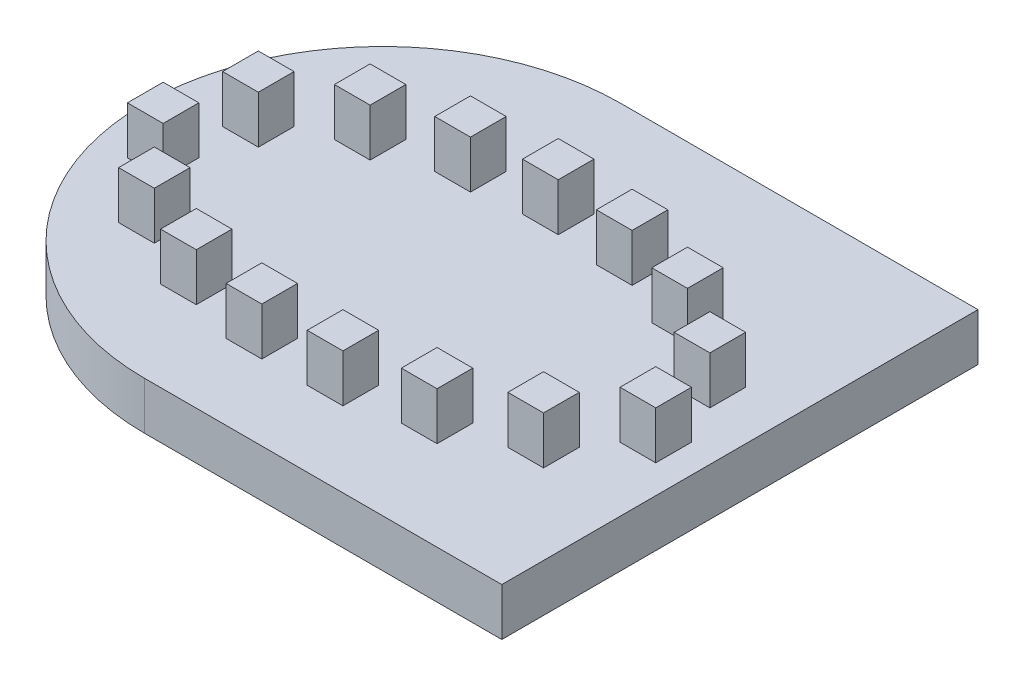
ISO-10303-21;
HEADER;
FILE_DESCRIPTION(('STEP AP214'),'2;1');
FILE_NAME('part.step','',(''),(''),'','','');
FILE_SCHEMA(('AUTOMOTIVE_DESIGN { 1 0 10303 214 1 1 1 1 }'));
ENDSEC;
DATA;
#1=APPLICATION_CONTEXT('core data for automotive mechanical design processes');
#2=APPLICATION_PROTOCOL_DEFINITION('international standard','automotive_design',2000,#1);
#3=PRODUCT_CONTEXT('',#1,'mechanical');
#4=PRODUCT('Part','Part','',(#3));
#5=PRODUCT_RELATED_PRODUCT_CATEGORY('part','',(#4));
#6=PRODUCT_DEFINITION_FORMATION('','',#4);
#7=PRODUCT_DEFINITION_CONTEXT('part definition',#1,'design');
#8=PRODUCT_DEFINITION('design','',#6,#7);
#9=PRODUCT_DEFINITION_SHAPE('','',#8);
#10=(LENGTH_UNIT() NAMED_UNIT(*) SI_UNIT(.MILLI.,.METRE.));
#11=(NAMED_UNIT(*) PLANE_ANGLE_UNIT() SI_UNIT($,.RADIAN.));
#12=(NAMED_UNIT(*) SI_UNIT($,.STERADIAN.) SOLID_ANGLE_UNIT());
#13=UNCERTAINTY_MEASURE_WITH_UNIT(LENGTH_MEASURE(1.E-05),#10,'distance_accuracy_value','');
#14=(GEOMETRIC_REPRESENTATION_CONTEXT(3) GLOBAL_UNCERTAINTY_ASSIGNED_CONTEXT((#13)) GLOBAL_UNIT_ASSIGNED_CONTEXT((#10,
#11,#12)) REPRESENTATION_CONTEXT('',''));
#15=CARTESIAN_POINT('',(0.,0.,0.));
#16=DIRECTION('',(0.,0.,1.));
#17=DIRECTION('',(1.,0.,0.));
#18=AXIS2_PLACEMENT_3D('',#15,#16,#17);
#19=CARTESIAN_POINT('',(-75.,20.,0.));
#20=DIRECTION('',(0.,1.,0.));
#21=DIRECTION('',(0.,0.,1.));
#22=AXIS2_PLACEMENT_3D('',#19,#20,#21);
#23=PLANE('',#22);
#24=DIRECTION('',(1.,0.,0.));
#25=VECTOR('',#24,1.);
#26=CARTESIAN_POINT('',(11.2592435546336,20.,-26.7223432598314));
#27=LINE('',#26,#25);
#28=CARTESIAN_POINT('',(11.2592435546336,20.,-26.7223432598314));
#29=VERTEX_POINT('',#28);
#30=CARTESIAN_POINT('',(26.2592435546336,20.,-26.7223432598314));
#31=VERTEX_POINT('',#30);
#32=EDGE_CURVE('E462',#29,#31,#27,.T.);
#33=ORIENTED_EDGE('',*,*,#32,.F.);
#34=DIRECTION('',(0.,0.,1.));
#35=VECTOR('',#34,1.);
#36=CARTESIAN_POINT('',(11.2592435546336,20.,-41.7223432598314));
#37=LINE('',#36,#35);
#38=CARTESIAN_POINT('',(11.2592435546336,20.,-41.7223432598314));
#39=VERTEX_POINT('',#38);
#40=EDGE_CURVE('E459',#39,#29,#37,.T.);
#41=ORIENTED_EDGE('',*,*,#40,.F.);
#42=DIRECTION('',(-1.,0.,0.));
#43=VECTOR('',#42,1.);
#44=CARTESIAN_POINT('',(11.2592435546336,20.,-41.7223432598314));
#45=LINE('',#44,#43);
#46=CARTESIAN_POINT('',(26.2592435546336,20.,-41.7223432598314));
#47=VERTEX_POINT('',#46);
#48=EDGE_CURVE('E471',#47,#39,#45,.T.);
#49=ORIENTED_EDGE('',*,*,#48,.F.);
#50=DIRECTION('',(0.,0.,-1.));
#51=VECTOR('',#50,1.);
#52=CARTESIAN_POINT('',(26.2592435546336,20.,-41.7223432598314));
#53=LINE('',#52,#51);
#54=EDGE_CURVE('E479',#31,#47,#53,.T.);
#55=ORIENTED_EDGE('',*,*,#54,.F.);
#56=EDGE_LOOP('',(#33,#41,#49,#55));
#57=FACE_BOUND('',#56,.T.);
#58=DIRECTION('',(1.,0.,0.));
#59=VECTOR('',#58,1.);
#60=CARTESIAN_POINT('',(48.0619634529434,20.,23.4005830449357));
#61=LINE('',#60,#59);
#62=CARTESIAN_POINT('',(48.0619634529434,20.,23.4005830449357));
#63=VERTEX_POINT('',#62);
#64=CARTESIAN_POINT('',(63.0619634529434,20.,23.4005830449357));
#65=VERTEX_POINT('',#64);
#66=EDGE_CURVE('E533',#63,#65,#61,.T.);
#67=ORIENTED_EDGE('',*,*,#66,.F.);
#68=DIRECTION('',(0.,0.,1.));
#69=VECTOR('',#68,1.);
#70=CARTESIAN_POINT('',(48.0619634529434,20.,8.40058304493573));
#71=LINE('',#70,#69);
#72=CARTESIAN_POINT('',(48.0619634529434,20.,8.40058304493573));
#73=VERTEX_POINT('',#72);
#74=EDGE_CURVE('E519',#73,#63,#71,.T.);
#75=ORIENTED_EDGE('',*,*,#74,.F.);
#76=DIRECTION('',(-1.,0.,0.));
#77=VECTOR('',#76,1.);
#78=CARTESIAN_POINT('',(48.0619634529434,20.,8.40058304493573));
#79=LINE('',#78,#77);
#80=CARTESIAN_POINT('',(63.0619634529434,20.,8.40058304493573));
#81=VERTEX_POINT('',#80);
#82=EDGE_CURVE('E524',#81,#73,#79,.T.);
#83=ORIENTED_EDGE('',*,*,#82,.F.);
#84=DIRECTION('',(0.,0.,-1.));
#85=VECTOR('',#84,1.);
#86=CARTESIAN_POINT('',(63.0619634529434,20.,8.40058304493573));
#87=LINE('',#86,#85);
#88=EDGE_CURVE('E535',#65,#81,#87,.T.);
#89=ORIENTED_EDGE('',*,*,#88,.F.);
#90=EDGE_LOOP('',(#67,#75,#83,#89));
#91=FACE_BOUND('',#90,.T.);
#92=DIRECTION('',(1.,0.,0.));
#93=VECTOR('',#92,1.);
#94=CARTESIAN_POINT('',(-4.82249930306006,20.,62.3672378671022));
#95=LINE('',#94,#93);
#96=CARTESIAN_POINT('',(-4.82249930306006,20.,62.3672378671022));
#97=VERTEX_POINT('',#96);
#98=CARTESIAN_POINT('',(10.1775006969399,20.,62.3672378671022));
#99=VERTEX_POINT('',#98);
#100=EDGE_CURVE('E591',#97,#99,#95,.T.);
#101=ORIENTED_EDGE('',*,*,#100,.F.);
#102=DIRECTION('',(0.,0.,1.));
#103=VECTOR('',#102,1.);
#104=CARTESIAN_POINT('',(-4.82249930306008,20.,47.3672378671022));
#105=LINE('',#104,#103);
#106=CARTESIAN_POINT('',(-4.82249930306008,20.,47.3672378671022));
#107=VERTEX_POINT('',#106);
#108=EDGE_CURVE('E577',#107,#97,#105,.T.);
#109=ORIENTED_EDGE('',*,*,#108,.F.);
#110=DIRECTION('',(-1.,0.,0.));
#111=VECTOR('',#110,1.);
#112=CARTESIAN_POINT('',(-4.82249930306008,20.,47.3672378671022));
#113=LINE('',#112,#111);
#114=CARTESIAN_POINT('',(10.1775006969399,20.,47.3672378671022));
#115=VERTEX_POINT('',#114);
#116=EDGE_CURVE('E582',#115,#107,#113,.T.);
#117=ORIENTED_EDGE('',*,*,#116,.F.);
#118=DIRECTION('',(0.,0.,-1.));
#119=VECTOR('',#118,1.);
#120=CARTESIAN_POINT('',(10.1775006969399,20.,47.3672378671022));
#121=LINE('',#120,#119);
#122=EDGE_CURVE('E593',#99,#115,#121,.T.);
#123=ORIENTED_EDGE('',*,*,#122,.F.);
#124=EDGE_LOOP('',(#101,#109,#117,#123));
#125=FACE_BOUND('',#124,.T.);
#126=DIRECTION('',(1.,0.,0.));
#127=VECTOR('',#126,1.);
#128=CARTESIAN_POINT('',(-72.4175228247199,20.,68.3694707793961));
#129=LINE('',#128,#127);
#130=CARTESIAN_POINT('',(-72.4175228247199,20.,68.3694707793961));
#131=VERTEX_POINT('',#130);
#132=CARTESIAN_POINT('',(-57.4175228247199,20.,68.3694707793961));
#133=VERTEX_POINT('',#132);
#134=EDGE_CURVE('E649',#131,#133,#129,.T.);
#135=ORIENTED_EDGE('',*,*,#134,.F.);
#136=DIRECTION('',(0.,0.,1.));
#137=VECTOR('',#136,1.);
#138=CARTESIAN_POINT('',(-72.4175228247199,20.,53.3694707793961));
#139=LINE('',#138,#137);
#140=CARTESIAN_POINT('',(-72.4175228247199,20.,53.3694707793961));
#141=VERTEX_POINT('',#140);
#142=EDGE_CURVE('E635',#141,#131,#139,.T.);
#143=ORIENTED_EDGE('',*,*,#142,.F.);
#144=DIRECTION('',(-1.,0.,0.));
#145=VECTOR('',#144,1.);
#146=CARTESIAN_POINT('',(-72.4175228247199,20.,53.3694707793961));
#147=LINE('',#146,#145);
#148=CARTESIAN_POINT('',(-57.4175228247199,20.,53.3694707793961));
#149=VERTEX_POINT('',#148);
#150=EDGE_CURVE('E640',#149,#141,#147,.T.);
#151=ORIENTED_EDGE('',*,*,#150,.F.);
#152=DIRECTION('',(0.,0.,-1.));
#153=VECTOR('',#152,1.);
#154=CARTESIAN_POINT('',(-57.4175228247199,20.,53.3694707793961));
#155=LINE('',#154,#153);
#156=EDGE_CURVE('E651',#133,#149,#155,.T.);
#157=ORIENTED_EDGE('',*,*,#156,.F.);
#158=EDGE_LOOP('',(#135,#143,#151,#157));
#159=FACE_BOUND('',#158,.T.);
#160=DIRECTION('',(1.,0.,0.));
#161=VECTOR('',#160,1.);
#162=CARTESIAN_POINT('',(-137.114089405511,20.,48.8138293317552));
#163=LINE('',#162,#161);
#164=CARTESIAN_POINT('',(-137.114089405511,20.,48.8138293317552));
#165=VERTEX_POINT('',#164);
#166=CARTESIAN_POINT('',(-122.114089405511,20.,48.8138293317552));
#167=VERTEX_POINT('',#166);
#168=EDGE_CURVE('E707',#165,#167,#163,.T.);
#169=ORIENTED_EDGE('',*,*,#168,.F.);
#170=DIRECTION('',(0.,0.,1.));
#171=VECTOR('',#170,1.);
#172=CARTESIAN_POINT('',(-137.114089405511,20.,33.8138293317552));
#173=LINE('',#172,#171);
#174=CARTESIAN_POINT('',(-137.114089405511,20.,33.8138293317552));
#175=VERTEX_POINT('',#174);
#176=EDGE_CURVE('E693',#175,#165,#173,.T.);
#177=ORIENTED_EDGE('',*,*,#176,.F.);
#178=DIRECTION('',(-1.,0.,0.));
#179=VECTOR('',#178,1.);
#180=CARTESIAN_POINT('',(-137.114089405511,20.,33.8138293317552));
#181=LINE('',#180,#179);
#182=CARTESIAN_POINT('',(-122.114089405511,20.,33.8138293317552));
#183=VERTEX_POINT('',#182);
#184=EDGE_CURVE('E698',#183,#175,#181,.T.);
#185=ORIENTED_EDGE('',*,*,#184,.F.);
#186=DIRECTION('',(0.,0.,-1.));
#187=VECTOR('',#186,1.);
#188=CARTESIAN_POINT('',(-122.114089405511,20.,33.8138293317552));
#189=LINE('',#188,#187);
#190=EDGE_CURVE('E709',#167,#183,#189,.T.);
#191=ORIENTED_EDGE('',*,*,#190,.F.);
#192=EDGE_LOOP('',(#169,#177,#185,#191));
#193=FACE_BOUND('',#192,.T.);
#194=DIRECTION('',(1.,0.,0.));
#195=VECTOR('',#194,1.);
#196=CARTESIAN_POINT('',(-150.201136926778,20.,-7.95403004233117));
#197=LINE('',#196,#195);
#198=CARTESIAN_POINT('',(-150.201136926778,20.,-7.95403004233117));
#199=VERTEX_POINT('',#198);
#200=CARTESIAN_POINT('',(-135.201136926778,20.,-7.95403004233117));
#201=VERTEX_POINT('',#200);
#202=EDGE_CURVE('E765',#199,#201,#197,.T.);
#203=ORIENTED_EDGE('',*,*,#202,.F.);
#204=DIRECTION('',(0.,0.,1.));
#205=VECTOR('',#204,1.);
#206=CARTESIAN_POINT('',(-150.201136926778,20.,-22.9540300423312));
#207=LINE('',#206,#205);
#208=CARTESIAN_POINT('',(-150.201136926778,20.,-22.9540300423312));
#209=VERTEX_POINT('',#208);
#210=EDGE_CURVE('E751',#209,#199,#207,.T.);
#211=ORIENTED_EDGE('',*,*,#210,.F.);
#212=DIRECTION('',(-1.,0.,0.));
#213=VECTOR('',#212,1.);
#214=CARTESIAN_POINT('',(-150.201136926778,20.,-22.9540300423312));
#215=LINE('',#214,#213);
#216=CARTESIAN_POINT('',(-135.201136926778,20.,-22.9540300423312));
#217=VERTEX_POINT('',#216);
#218=EDGE_CURVE('E756',#217,#209,#215,.T.);
#219=ORIENTED_EDGE('',*,*,#218,.F.);
#220=DIRECTION('',(0.,0.,-1.));
#221=VECTOR('',#220,1.);
#222=CARTESIAN_POINT('',(-135.201136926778,20.,-22.9540300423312));
#223=LINE('',#222,#221);
#224=EDGE_CURVE('E767',#201,#217,#223,.T.);
#225=ORIENTED_EDGE('',*,*,#224,.F.);
#226=EDGE_LOOP('',(#203,#211,#219,#225));
#227=FACE_BOUND('',#226,.T.);
#228=DIRECTION('',(1.,0.,0.));
#229=VECTOR('',#228,1.);
#230=CARTESIAN_POINT('',(-89.3240760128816,20.,-36.1697899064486));
#231=LINE('',#230,#229);
#232=CARTESIAN_POINT('',(-89.3240760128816,20.,-36.1697899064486));
#233=VERTEX_POINT('',#232);
#234=CARTESIAN_POINT('',(-74.3240760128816,20.,-36.1697899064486));
#235=VERTEX_POINT('',#234);
#236=EDGE_CURVE('E823',#233,#235,#231,.T.);
#237=ORIENTED_EDGE('',*,*,#236,.F.);
#238=DIRECTION('',(0.,0.,1.));
#239=VECTOR('',#238,1.);
#240=CARTESIAN_POINT('',(-89.3240760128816,20.,-51.1697899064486));
#241=LINE('',#240,#239);
#242=CARTESIAN_POINT('',(-89.3240760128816,20.,-51.1697899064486));
#243=VERTEX_POINT('',#242);
#244=EDGE_CURVE('E809',#243,#233,#241,.T.);
#245=ORIENTED_EDGE('',*,*,#244,.F.);
#246=DIRECTION('',(-1.,0.,0.));
#247=VECTOR('',#246,1.);
#248=CARTESIAN_POINT('',(-89.3240760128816,20.,-51.1697899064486));
#249=LINE('',#248,#247);
#250=CARTESIAN_POINT('',(-74.3240760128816,20.,-51.1697899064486));
#251=VERTEX_POINT('',#250);
#252=EDGE_CURVE('E814',#251,#243,#249,.T.);
#253=ORIENTED_EDGE('',*,*,#252,.F.);
#254=DIRECTION('',(0.,0.,-1.));
#255=VECTOR('',#254,1.);
#256=CARTESIAN_POINT('',(-74.3240760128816,20.,-51.1697899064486));
#257=LINE('',#256,#255);
#258=EDGE_CURVE('E825',#235,#251,#257,.T.);
#259=ORIENTED_EDGE('',*,*,#258,.F.);
#260=EDGE_LOOP('',(#237,#245,#253,#259));
#261=FACE_BOUND('',#260,.T.);
#262=CARTESIAN_POINT('',(-75.,20.,0.));
#263=DIRECTION('',(0.,1.,0.));
#264=DIRECTION('',(0.,0.,1.));
#265=AXIS2_PLACEMENT_3D('',#262,#263,#264);
#266=CIRCLE('',#265,100.);
#267=CARTESIAN_POINT('',(-75.,20.,-100.));
#268=VERTEX_POINT('',#267);
#269=CARTESIAN_POINT('',(-75.,20.,100.));
#270=VERTEX_POINT('',#269);
#271=EDGE_CURVE('E876',#268,#270,#266,.T.);
#272=ORIENTED_EDGE('',*,*,#271,.T.);
#273=DIRECTION('',(1.,0.,0.));
#274=VECTOR('',#273,1.);
#275=CARTESIAN_POINT('',(-75.,20.,100.));
#276=LINE('',#275,#274);
#277=CARTESIAN_POINT('',(75.,20.,100.));
#278=VERTEX_POINT('',#277);
#279=EDGE_CURVE('E879',#270,#278,#276,.T.);
#280=ORIENTED_EDGE('',*,*,#279,.T.);
#281=DIRECTION('',(0.,0.,-1.));
#282=VECTOR('',#281,1.);
#283=CARTESIAN_POINT('',(75.,20.,-100.));
#284=LINE('',#283,#282);
#285=CARTESIAN_POINT('',(75.,20.,-100.));
#286=VERTEX_POINT('',#285);
#287=EDGE_CURVE('E881',#278,#286,#284,.T.);
#288=ORIENTED_EDGE('',*,*,#287,.T.);
#289=DIRECTION('',(-1.,0.,0.));
#290=VECTOR('',#289,1.);
#291=CARTESIAN_POINT('',(-75.,20.,-100.));
#292=LINE('',#291,#290);
#293=EDGE_CURVE('E883',#286,#268,#292,.T.);
#294=ORIENTED_EDGE('',*,*,#293,.T.);
#295=EDGE_LOOP('',(#272,#280,#288,#294));
#296=FACE_BOUND('',#295,.T.);
#297=DIRECTION('',(1.,0.,0.));
#298=VECTOR('',#297,1.);
#299=CARTESIAN_POINT('',(-55.3825979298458,20.,-39.0899983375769));
#300=LINE('',#299,#298);
#301=CARTESIAN_POINT('',(-55.3825979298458,20.,-39.0899983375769));
#302=VERTEX_POINT('',#301);
#303=CARTESIAN_POINT('',(-40.3825979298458,20.,-39.089998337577));
#304=VERTEX_POINT('',#303);
#305=EDGE_CURVE('E841',#302,#304,#300,.T.);
#306=ORIENTED_EDGE('',*,*,#305,.F.);
#307=DIRECTION('',(0.,0.,1.));
#308=VECTOR('',#307,1.);
#309=CARTESIAN_POINT('',(-55.3825979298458,20.,-54.0899983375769));
#310=LINE('',#309,#308);
#311=CARTESIAN_POINT('',(-55.3825979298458,20.,-54.0899983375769));
#312=VERTEX_POINT('',#311);
#313=EDGE_CURVE('E838',#312,#302,#310,.T.);
#314=ORIENTED_EDGE('',*,*,#313,.F.);
#315=DIRECTION('',(-1.,0.,0.));
#316=VECTOR('',#315,1.);
#317=CARTESIAN_POINT('',(-55.3825979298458,20.,-54.0899983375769));
#318=LINE('',#317,#316);
#319=CARTESIAN_POINT('',(-40.3825979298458,20.,-54.089998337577));
#320=VERTEX_POINT('',#319);
#321=EDGE_CURVE('E846',#320,#312,#318,.T.);
#322=ORIENTED_EDGE('',*,*,#321,.F.);
#323=DIRECTION('',(0.,0.,-1.));
#324=VECTOR('',#323,1.);
#325=CARTESIAN_POINT('',(-40.3825979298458,20.,-54.089998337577));
#326=LINE('',#325,#324);
#327=EDGE_CURVE('E843',#304,#320,#326,.T.);
#328=ORIENTED_EDGE('',*,*,#327,.F.);
#329=EDGE_LOOP('',(#306,#314,#322,#328));
#330=FACE_BOUND('',#329,.T.);
#331=DIRECTION('',(1.,0.,0.));
#332=VECTOR('',#331,1.);
#333=CARTESIAN_POINT('',(-122.024439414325,20.,-26.7223432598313));
#334=LINE('',#333,#332);
#335=CARTESIAN_POINT('',(-122.024439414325,20.,-26.7223432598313));
#336=VERTEX_POINT('',#335);
#337=CARTESIAN_POINT('',(-107.024439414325,20.,-26.7223432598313));
#338=VERTEX_POINT('',#337);
#339=EDGE_CURVE('E794',#336,#338,#334,.T.);
#340=ORIENTED_EDGE('',*,*,#339,.F.);
#341=DIRECTION('',(0.,0.,1.));
#342=VECTOR('',#341,1.);
#343=CARTESIAN_POINT('',(-122.024439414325,20.,-41.7223432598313));
#344=LINE('',#343,#342);
#345=CARTESIAN_POINT('',(-122.024439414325,20.,-41.7223432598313));
#346=VERTEX_POINT('',#345);
#347=EDGE_CURVE('E780',#346,#336,#344,.T.);
#348=ORIENTED_EDGE('',*,*,#347,.F.);
#349=DIRECTION('',(-1.,0.,0.));
#350=VECTOR('',#349,1.);
#351=CARTESIAN_POINT('',(-122.024439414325,20.,-41.7223432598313));
#352=LINE('',#351,#350);
#353=CARTESIAN_POINT('',(-107.024439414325,20.,-41.7223432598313));
#354=VERTEX_POINT('',#353);
#355=EDGE_CURVE('E785',#354,#346,#352,.T.);
#356=ORIENTED_EDGE('',*,*,#355,.F.);
#357=DIRECTION('',(0.,0.,-1.));
#358=VECTOR('',#357,1.);
#359=CARTESIAN_POINT('',(-107.024439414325,20.,-41.7223432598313));
#360=LINE('',#359,#358);
#361=EDGE_CURVE('E796',#338,#354,#360,.T.);
#362=ORIENTED_EDGE('',*,*,#361,.F.);
#363=EDGE_LOOP('',(#340,#348,#356,#362));
#364=FACE_BOUND('',#363,.T.);
#365=DIRECTION('',(1.,0.,0.));
#366=VECTOR('',#365,1.);
#367=CARTESIAN_POINT('',(-158.827159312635,20.,23.4005830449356));
#368=LINE('',#367,#366);
#369=CARTESIAN_POINT('',(-158.827159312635,20.,23.4005830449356));
#370=VERTEX_POINT('',#369);
#371=CARTESIAN_POINT('',(-143.827159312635,20.,23.4005830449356));
#372=VERTEX_POINT('',#371);
#373=EDGE_CURVE('E736',#370,#372,#368,.T.);
#374=ORIENTED_EDGE('',*,*,#373,.F.);
#375=DIRECTION('',(0.,0.,1.));
#376=VECTOR('',#375,1.);
#377=CARTESIAN_POINT('',(-158.827159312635,20.,8.40058304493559));
#378=LINE('',#377,#376);
#379=CARTESIAN_POINT('',(-158.827159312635,20.,8.40058304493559));
#380=VERTEX_POINT('',#379);
#381=EDGE_CURVE('E722',#380,#370,#378,.T.);
#382=ORIENTED_EDGE('',*,*,#381,.F.);
#383=DIRECTION('',(-1.,0.,0.));
#384=VECTOR('',#383,1.);
#385=CARTESIAN_POINT('',(-158.827159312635,20.,8.40058304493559));
#386=LINE('',#385,#384);
#387=CARTESIAN_POINT('',(-143.827159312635,20.,8.40058304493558));
#388=VERTEX_POINT('',#387);
#389=EDGE_CURVE('E727',#388,#380,#386,.T.);
#390=ORIENTED_EDGE('',*,*,#389,.F.);
#391=DIRECTION('',(0.,0.,-1.));
#392=VECTOR('',#391,1.);
#393=CARTESIAN_POINT('',(-143.827159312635,20.,8.40058304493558));
#394=LINE('',#393,#392);
#395=EDGE_CURVE('E738',#372,#388,#394,.T.);
#396=ORIENTED_EDGE('',*,*,#395,.F.);
#397=EDGE_LOOP('',(#374,#382,#390,#396));
#398=FACE_BOUND('',#397,.T.);
#399=DIRECTION('',(1.,0.,0.));
#400=VECTOR('',#399,1.);
#401=CARTESIAN_POINT('',(-105.942696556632,20.,62.3672378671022));
#402=LINE('',#401,#400);
#403=CARTESIAN_POINT('',(-105.942696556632,20.,62.3672378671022));
#404=VERTEX_POINT('',#403);
#405=CARTESIAN_POINT('',(-90.9426965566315,20.,62.3672378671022));
#406=VERTEX_POINT('',#405);
#407=EDGE_CURVE('E678',#404,#406,#402,.T.);
#408=ORIENTED_EDGE('',*,*,#407,.F.);
#409=DIRECTION('',(0.,0.,1.));
#410=VECTOR('',#409,1.);
#411=CARTESIAN_POINT('',(-105.942696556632,20.,47.3672378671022));
#412=LINE('',#411,#410);
#413=CARTESIAN_POINT('',(-105.942696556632,20.,47.3672378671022));
#414=VERTEX_POINT('',#413);
#415=EDGE_CURVE('E664',#414,#404,#412,.T.);
#416=ORIENTED_EDGE('',*,*,#415,.F.);
#417=DIRECTION('',(-1.,0.,0.));
#418=VECTOR('',#417,1.);
#419=CARTESIAN_POINT('',(-105.942696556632,20.,47.3672378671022));
#420=LINE('',#419,#418);
#421=CARTESIAN_POINT('',(-90.9426965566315,20.,47.3672378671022));
#422=VERTEX_POINT('',#421);
#423=EDGE_CURVE('E669',#422,#414,#420,.T.);
#424=ORIENTED_EDGE('',*,*,#423,.F.);
#425=DIRECTION('',(0.,0.,-1.));
#426=VECTOR('',#425,1.);
#427=CARTESIAN_POINT('',(-90.9426965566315,20.,47.3672378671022));
#428=LINE('',#427,#426);
#429=EDGE_CURVE('E680',#406,#422,#428,.T.);
#430=ORIENTED_EDGE('',*,*,#429,.F.);
#431=EDGE_LOOP('',(#408,#416,#424,#430));
#432=FACE_BOUND('',#431,.T.);
#433=DIRECTION('',(1.,0.,0.));
#434=VECTOR('',#433,1.);
#435=CARTESIAN_POINT('',(-38.347673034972,20.,68.3694707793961));
#436=LINE('',#435,#434);
#437=CARTESIAN_POINT('',(-38.347673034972,20.,68.3694707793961));
#438=VERTEX_POINT('',#437);
#439=CARTESIAN_POINT('',(-23.347673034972,20.,68.3694707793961));
#440=VERTEX_POINT('',#439);
#441=EDGE_CURVE('E620',#438,#440,#436,.T.);
#442=ORIENTED_EDGE('',*,*,#441,.F.);
#443=DIRECTION('',(0.,0.,1.));
#444=VECTOR('',#443,1.);
#445=CARTESIAN_POINT('',(-38.347673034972,20.,53.3694707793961));
#446=LINE('',#445,#444);
#447=CARTESIAN_POINT('',(-38.347673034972,20.,53.3694707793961));
#448=VERTEX_POINT('',#447);
#449=EDGE_CURVE('E606',#448,#438,#446,.T.);
#450=ORIENTED_EDGE('',*,*,#449,.F.);
#451=DIRECTION('',(-1.,0.,0.));
#452=VECTOR('',#451,1.);
#453=CARTESIAN_POINT('',(-38.347673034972,20.,53.3694707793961));
#454=LINE('',#453,#452);
#455=CARTESIAN_POINT('',(-23.347673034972,20.,53.3694707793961));
#456=VERTEX_POINT('',#455);
#457=EDGE_CURVE('E611',#456,#448,#454,.T.);
#458=ORIENTED_EDGE('',*,*,#457,.F.);
#459=DIRECTION('',(0.,0.,-1.));
#460=VECTOR('',#459,1.);
#461=CARTESIAN_POINT('',(-23.347673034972,20.,53.3694707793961));
#462=LINE('',#461,#460);
#463=EDGE_CURVE('E622',#440,#456,#462,.T.);
#464=ORIENTED_EDGE('',*,*,#463,.F.);
#465=EDGE_LOOP('',(#442,#450,#458,#464));
#466=FACE_BOUND('',#465,.T.);
#467=DIRECTION('',(1.,0.,0.));
#468=VECTOR('',#467,1.);
#469=CARTESIAN_POINT('',(26.3488935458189,20.,48.8138293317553));
#470=LINE('',#469,#468);
#471=CARTESIAN_POINT('',(26.3488935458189,20.,48.8138293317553));
#472=VERTEX_POINT('',#471);
#473=CARTESIAN_POINT('',(41.348893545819,20.,48.8138293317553));
#474=VERTEX_POINT('',#473);
#475=EDGE_CURVE('E562',#472,#474,#470,.T.);
#476=ORIENTED_EDGE('',*,*,#475,.F.);
#477=DIRECTION('',(0.,0.,1.));
#478=VECTOR('',#477,1.);
#479=CARTESIAN_POINT('',(26.3488935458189,20.,33.8138293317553));
#480=LINE('',#479,#478);
#481=CARTESIAN_POINT('',(26.3488935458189,20.,33.8138293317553));
#482=VERTEX_POINT('',#481);
#483=EDGE_CURVE('E548',#482,#472,#480,.T.);
#484=ORIENTED_EDGE('',*,*,#483,.F.);
#485=DIRECTION('',(-1.,0.,0.));
#486=VECTOR('',#485,1.);
#487=CARTESIAN_POINT('',(26.3488935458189,20.,33.8138293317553));
#488=LINE('',#487,#486);
#489=CARTESIAN_POINT('',(41.348893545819,20.,33.8138293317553));
#490=VERTEX_POINT('',#489);
#491=EDGE_CURVE('E553',#490,#482,#488,.T.);
#492=ORIENTED_EDGE('',*,*,#491,.F.);
#493=DIRECTION('',(0.,0.,-1.));
#494=VECTOR('',#493,1.);
#495=CARTESIAN_POINT('',(41.348893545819,20.,33.8138293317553));
#496=LINE('',#495,#494);
#497=EDGE_CURVE('E564',#474,#490,#496,.T.);
#498=ORIENTED_EDGE('',*,*,#497,.F.);
#499=EDGE_LOOP('',(#476,#484,#492,#498));
#500=FACE_BOUND('',#499,.T.);
#501=DIRECTION('',(1.,0.,0.));
#502=VECTOR('',#501,1.);
#503=CARTESIAN_POINT('',(39.4359410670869,20.,-7.95403004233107));
#504=LINE('',#503,#502);
#505=CARTESIAN_POINT('',(39.4359410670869,20.,-7.95403004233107));
#506=VERTEX_POINT('',#505);
#507=CARTESIAN_POINT('',(54.4359410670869,20.,-7.95403004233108));
#508=VERTEX_POINT('',#507);
#509=EDGE_CURVE('E504',#506,#508,#504,.T.);
#510=ORIENTED_EDGE('',*,*,#509,.F.);
#511=DIRECTION('',(0.,0.,1.));
#512=VECTOR('',#511,1.);
#513=CARTESIAN_POINT('',(39.4359410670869,20.,-22.9540300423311));
#514=LINE('',#513,#512);
#515=CARTESIAN_POINT('',(39.4359410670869,20.,-22.9540300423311));
#516=VERTEX_POINT('',#515);
#517=EDGE_CURVE('E490',#516,#506,#514,.T.);
#518=ORIENTED_EDGE('',*,*,#517,.F.);
#519=DIRECTION('',(-1.,0.,0.));
#520=VECTOR('',#519,1.);
#521=CARTESIAN_POINT('',(39.4359410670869,20.,-22.9540300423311));
#522=LINE('',#521,#520);
#523=CARTESIAN_POINT('',(54.4359410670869,20.,-22.9540300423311));
#524=VERTEX_POINT('',#523);
#525=EDGE_CURVE('E495',#524,#516,#522,.T.);
#526=ORIENTED_EDGE('',*,*,#525,.F.);
#527=DIRECTION('',(0.,0.,-1.));
#528=VECTOR('',#527,1.);
#529=CARTESIAN_POINT('',(54.4359410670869,20.,-22.9540300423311));
#530=LINE('',#529,#528);
#531=EDGE_CURVE('E506',#508,#524,#530,.T.);
#532=ORIENTED_EDGE('',*,*,#531,.F.);
#533=EDGE_LOOP('',(#510,#518,#526,#532));
#534=FACE_BOUND('',#533,.T.);
#535=DIRECTION('',(1.,0.,0.));
#536=VECTOR('',#535,1.);
#537=CARTESIAN_POINT('',(-21.4411198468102,20.,-36.1697899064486));
#538=LINE('',#537,#536);
#539=CARTESIAN_POINT('',(-21.4411198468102,20.,-36.1697899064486));
#540=VERTEX_POINT('',#539);
#541=CARTESIAN_POINT('',(-6.44111984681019,20.,-36.1697899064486));
#542=VERTEX_POINT('',#541);
#543=EDGE_CURVE('E1710',#540,#542,#538,.T.);
#544=ORIENTED_EDGE('',*,*,#543,.F.);
#545=DIRECTION('',(0.,0.,1.));
#546=VECTOR('',#545,1.);
#547=CARTESIAN_POINT('',(-21.4411198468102,20.,-51.1697899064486));
#548=LINE('',#547,#546);
#549=CARTESIAN_POINT('',(-21.4411198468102,20.,-51.1697899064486));
#550=VERTEX_POINT('',#549);
#551=EDGE_CURVE('E457',#550,#540,#548,.T.);
#552=ORIENTED_EDGE('',*,*,#551,.F.);
#553=DIRECTION('',(-1.,0.,0.));
#554=VECTOR('',#553,1.);
#555=CARTESIAN_POINT('',(-21.4411198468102,20.,-51.1697899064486));
#556=LINE('',#555,#554);
#557=CARTESIAN_POINT('',(-6.44111984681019,20.,-51.1697899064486));
#558=VERTEX_POINT('',#557);
#559=EDGE_CURVE('E453',#558,#550,#556,.T.);
#560=ORIENTED_EDGE('',*,*,#559,.F.);
#561=DIRECTION('',(0.,0.,-1.));
#562=VECTOR('',#561,1.);
#563=CARTESIAN_POINT('',(-6.44111984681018,20.,-51.1697899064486));
#564=LINE('',#563,#562);
#565=EDGE_CURVE('E1707',#542,#558,#564,.T.);
#566=ORIENTED_EDGE('',*,*,#565,.F.);
#567=EDGE_LOOP('',(#544,#552,#560,#566));
#568=FACE_BOUND('',#567,.T.);
#569=ADVANCED_FACE('F32',(#57,#91,#125,#159,#193,#227,#261,#296,#330,#364,#398,#432,#466,#500,
#534,#568),#23,.T.);
#570=CARTESIAN_POINT('',(-75.,20.,0.));
#571=DIRECTION('',(0.,-1.,0.));
#572=DIRECTION('',(0.,0.,-1.));
#573=AXIS2_PLACEMENT_3D('',#570,#571,#572);
#574=CYLINDRICAL_SURFACE('',#573,100.);
#575=CARTESIAN_POINT('',(-75.,0.,0.));
#576=DIRECTION('',(0.,1.,0.));
#577=DIRECTION('',(0.,0.,1.));
#578=AXIS2_PLACEMENT_3D('',#575,#576,#577);
#579=CIRCLE('',#578,100.);
#580=CARTESIAN_POINT('',(-75.,0.,-100.));
#581=VERTEX_POINT('',#580);
#582=CARTESIAN_POINT('',(-75.,0.,100.));
#583=VERTEX_POINT('',#582);
#584=EDGE_CURVE('E867',#581,#583,#579,.T.);
#585=ORIENTED_EDGE('',*,*,#584,.T.);
#586=DIRECTION('',(0.,-1.,0.));
#587=VECTOR('',#586,1.);
#588=CARTESIAN_POINT('',(-75.,20.,100.));
#589=LINE('',#588,#587);
#590=EDGE_CURVE('E11',#270,#583,#589,.T.);
#591=ORIENTED_EDGE('',*,*,#590,.F.);
#592=ORIENTED_EDGE('',*,*,#271,.F.);
#593=DIRECTION('',(0.,-1.,0.));
#594=VECTOR('',#593,1.);
#595=CARTESIAN_POINT('',(-75.,20.,-100.));
#596=LINE('',#595,#594);
#597=EDGE_CURVE('E885',#268,#581,#596,.T.);
#598=ORIENTED_EDGE('',*,*,#597,.T.);
#599=EDGE_LOOP('',(#585,#591,#592,#598));
#600=FACE_BOUND('',#599,.T.);
#601=ADVANCED_FACE('F34',(#600),#574,.T.);
#602=CARTESIAN_POINT('',(-75.,20.,100.));
#603=DIRECTION('',(0.,0.,-1.));
#604=DIRECTION('',(-1.,0.,0.));
#605=AXIS2_PLACEMENT_3D('',#602,#603,#604);
#606=PLANE('',#605);
#607=DIRECTION('',(1.,0.,0.));
#608=VECTOR('',#607,1.);
#609=CARTESIAN_POINT('',(-75.,0.,100.));
#610=LINE('',#609,#608);
#611=CARTESIAN_POINT('',(75.,0.,100.));
#612=VERTEX_POINT('',#611);
#613=EDGE_CURVE('E870',#583,#612,#610,.T.);
#614=ORIENTED_EDGE('',*,*,#613,.T.);
#615=DIRECTION('',(0.,-1.,0.));
#616=VECTOR('',#615,1.);
#617=CARTESIAN_POINT('',(75.,20.,100.));
#618=LINE('',#617,#616);
#619=EDGE_CURVE('E40',#278,#612,#618,.T.);
#620=ORIENTED_EDGE('',*,*,#619,.F.);
#621=ORIENTED_EDGE('',*,*,#279,.F.);
#622=ORIENTED_EDGE('',*,*,#590,.T.);
#623=EDGE_LOOP('',(#614,#620,#621,#622));
#624=FACE_BOUND('',#623,.T.);
#625=ADVANCED_FACE('F911',(#624),#606,.F.);
#626=CARTESIAN_POINT('',(75.,20.,-100.));
#627=DIRECTION('',(-1.,0.,0.));
#628=DIRECTION('',(0.,0.,1.));
#629=AXIS2_PLACEMENT_3D('',#626,#627,#628);
#630=PLANE('',#629);
#631=DIRECTION('',(0.,0.,-1.));
#632=VECTOR('',#631,1.);
#633=CARTESIAN_POINT('',(75.,0.,-100.));
#634=LINE('',#633,#632);
#635=CARTESIAN_POINT('',(75.,0.,-100.));
#636=VERTEX_POINT('',#635);
#637=EDGE_CURVE('E872',#612,#636,#634,.T.);
#638=ORIENTED_EDGE('',*,*,#637,.T.);
#639=DIRECTION('',(0.,-1.,0.));
#640=VECTOR('',#639,1.);
#641=CARTESIAN_POINT('',(75.,20.,-100.));
#642=LINE('',#641,#640);
#643=EDGE_CURVE('E888',#286,#636,#642,.T.);
#644=ORIENTED_EDGE('',*,*,#643,.F.);
#645=ORIENTED_EDGE('',*,*,#287,.F.);
#646=ORIENTED_EDGE('',*,*,#619,.T.);
#647=EDGE_LOOP('',(#638,#644,#645,#646));
#648=FACE_BOUND('',#647,.T.);
#649=ADVANCED_FACE('F895',(#648),#630,.F.);
#650=CARTESIAN_POINT('',(-75.,20.,-100.));
#651=DIRECTION('',(0.,0.,1.));
#652=DIRECTION('',(1.,0.,0.));
#653=AXIS2_PLACEMENT_3D('',#650,#651,#652);
#654=PLANE('',#653);
#655=DIRECTION('',(-1.,0.,0.));
#656=VECTOR('',#655,1.);
#657=CARTESIAN_POINT('',(-75.,0.,-100.));
#658=LINE('',#657,#656);
#659=EDGE_CURVE('E874',#636,#581,#658,.T.);
#660=ORIENTED_EDGE('',*,*,#659,.T.);
#661=ORIENTED_EDGE('',*,*,#597,.F.);
#662=ORIENTED_EDGE('',*,*,#293,.F.);
#663=ORIENTED_EDGE('',*,*,#643,.T.);
#664=EDGE_LOOP('',(#660,#661,#662,#663));
#665=FACE_BOUND('',#664,.T.);
#666=ADVANCED_FACE('F904',(#665),#654,.F.);
#667=CARTESIAN_POINT('',(-75.,0.,0.));
#668=DIRECTION('',(0.,1.,0.));
#669=DIRECTION('',(0.,0.,1.));
#670=AXIS2_PLACEMENT_3D('',#667,#668,#669);
#671=PLANE('',#670);
#672=ORIENTED_EDGE('',*,*,#584,.F.);
#673=ORIENTED_EDGE('',*,*,#659,.F.);
#674=ORIENTED_EDGE('',*,*,#637,.F.);
#675=ORIENTED_EDGE('',*,*,#613,.F.);
#676=EDGE_LOOP('',(#672,#673,#674,#675));
#677=FACE_BOUND('',#676,.T.);
#678=ADVANCED_FACE('F901',(#677),#671,.F.);
#679=CARTESIAN_POINT('',(-55.3825979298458,40.,-54.0899983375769));
#680=DIRECTION('',(1.,0.,0.));
#681=DIRECTION('',(0.,0.,-1.));
#682=AXIS2_PLACEMENT_3D('',#679,#680,#681);
#683=PLANE('',#682);
#684=ORIENTED_EDGE('',*,*,#313,.T.);
#685=DIRECTION('',(0.,-1.,0.));
#686=VECTOR('',#685,1.);
#687=CARTESIAN_POINT('',(-55.3825979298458,40.,-39.0899983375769));
#688=LINE('',#687,#686);
#689=CARTESIAN_POINT('',(-55.3825979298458,40.,-39.0899983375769));
#690=VERTEX_POINT('',#689);
#691=EDGE_CURVE('E865',#690,#302,#688,.T.);
#692=ORIENTED_EDGE('',*,*,#691,.F.);
#693=DIRECTION('',(0.,0.,1.));
#694=VECTOR('',#693,1.);
#695=CARTESIAN_POINT('',(-55.3825979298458,40.,-54.0899983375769));
#696=LINE('',#695,#694);
#697=CARTESIAN_POINT('',(-55.3825979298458,40.,-54.0899983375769));
#698=VERTEX_POINT('',#697);
#699=EDGE_CURVE('E848',#698,#690,#696,.T.);
#700=ORIENTED_EDGE('',*,*,#699,.F.);
#701=DIRECTION('',(0.,-1.,0.));
#702=VECTOR('',#701,1.);
#703=CARTESIAN_POINT('',(-55.3825979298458,40.,-54.0899983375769));
#704=LINE('',#703,#702);
#705=EDGE_CURVE('E857',#698,#312,#704,.T.);
#706=ORIENTED_EDGE('',*,*,#705,.T.);
#707=EDGE_LOOP('',(#684,#692,#700,#706));
#708=FACE_BOUND('',#707,.T.);
#709=ADVANCED_FACE('F932',(#708),#683,.F.);
#710=CARTESIAN_POINT('',(-55.3825979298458,40.,-39.0899983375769));
#711=DIRECTION('',(0.,0.,-1.));
#712=DIRECTION('',(-1.,0.,0.));
#713=AXIS2_PLACEMENT_3D('',#710,#711,#712);
#714=PLANE('',#713);
#715=ORIENTED_EDGE('',*,*,#305,.T.);
#716=DIRECTION('',(0.,-1.,0.));
#717=VECTOR('',#716,1.);
#718=CARTESIAN_POINT('',(-40.3825979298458,40.,-39.089998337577));
#719=LINE('',#718,#717);
#720=CARTESIAN_POINT('',(-40.3825979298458,40.,-39.089998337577));
#721=VERTEX_POINT('',#720);
#722=EDGE_CURVE('E862',#721,#304,#719,.T.);
#723=ORIENTED_EDGE('',*,*,#722,.F.);
#724=DIRECTION('',(1.,0.,0.));
#725=VECTOR('',#724,1.);
#726=CARTESIAN_POINT('',(-55.3825979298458,40.,-39.0899983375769));
#727=LINE('',#726,#725);
#728=EDGE_CURVE('E851',#690,#721,#727,.T.);
#729=ORIENTED_EDGE('',*,*,#728,.F.);
#730=ORIENTED_EDGE('',*,*,#691,.T.);
#731=EDGE_LOOP('',(#715,#723,#729,#730));
#732=FACE_BOUND('',#731,.T.);
#733=ADVANCED_FACE('F936',(#732),#714,.F.);
#734=CARTESIAN_POINT('',(-40.3825979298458,40.,-54.089998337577));
#735=DIRECTION('',(-1.,0.,0.));
#736=DIRECTION('',(0.,0.,1.));
#737=AXIS2_PLACEMENT_3D('',#734,#735,#736);
#738=PLANE('',#737);
#739=ORIENTED_EDGE('',*,*,#327,.T.);
#740=DIRECTION('',(0.,-1.,0.));
#741=VECTOR('',#740,1.);
#742=CARTESIAN_POINT('',(-40.3825979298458,40.,-54.089998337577));
#743=LINE('',#742,#741);
#744=CARTESIAN_POINT('',(-40.3825979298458,40.,-54.089998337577));
#745=VERTEX_POINT('',#744);
#746=EDGE_CURVE('E860',#745,#320,#743,.T.);
#747=ORIENTED_EDGE('',*,*,#746,.F.);
#748=DIRECTION('',(0.,0.,-1.));
#749=VECTOR('',#748,1.);
#750=CARTESIAN_POINT('',(-40.3825979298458,40.,-54.089998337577));
#751=LINE('',#750,#749);
#752=EDGE_CURVE('E853',#721,#745,#751,.T.);
#753=ORIENTED_EDGE('',*,*,#752,.F.);
#754=ORIENTED_EDGE('',*,*,#722,.T.);
#755=EDGE_LOOP('',(#739,#747,#753,#754));
#756=FACE_BOUND('',#755,.T.);
#757=ADVANCED_FACE('F941',(#756),#738,.F.);
#758=CARTESIAN_POINT('',(-55.3825979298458,40.,-54.0899983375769));
#759=DIRECTION('',(0.,0.,1.));
#760=DIRECTION('',(1.,0.,0.));
#761=AXIS2_PLACEMENT_3D('',#758,#759,#760);
#762=PLANE('',#761);
#763=ORIENTED_EDGE('',*,*,#321,.T.);
#764=ORIENTED_EDGE('',*,*,#705,.F.);
#765=DIRECTION('',(-1.,0.,0.));
#766=VECTOR('',#765,1.);
#767=CARTESIAN_POINT('',(-55.3825979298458,40.,-54.0899983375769));
#768=LINE('',#767,#766);
#769=EDGE_CURVE('E855',#745,#698,#768,.T.);
#770=ORIENTED_EDGE('',*,*,#769,.F.);
#771=ORIENTED_EDGE('',*,*,#746,.T.);
#772=EDGE_LOOP('',(#763,#764,#770,#771));
#773=FACE_BOUND('',#772,.T.);
#774=ADVANCED_FACE('F947',(#773),#762,.F.);
#775=CARTESIAN_POINT('',(-55.3825979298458,40.,-39.0899983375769));
#776=DIRECTION('',(0.,1.,0.));
#777=DIRECTION('',(0.,0.,1.));
#778=AXIS2_PLACEMENT_3D('',#775,#776,#777);
#779=PLANE('',#778);
#780=ORIENTED_EDGE('',*,*,#699,.T.);
#781=ORIENTED_EDGE('',*,*,#728,.T.);
#782=ORIENTED_EDGE('',*,*,#752,.T.);
#783=ORIENTED_EDGE('',*,*,#769,.T.);
#784=EDGE_LOOP('',(#780,#781,#782,#783));
#785=FACE_BOUND('',#784,.T.);
#786=ADVANCED_FACE('F951',(#785),#779,.T.);
#787=CARTESIAN_POINT('',(-89.3240760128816,40.,-51.1697899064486));
#788=DIRECTION('',(1.,0.,0.));
#789=DIRECTION('',(0.,0.,-1.));
#790=AXIS2_PLACEMENT_3D('',#787,#788,#789);
#791=PLANE('',#790);
#792=ORIENTED_EDGE('',*,*,#244,.T.);
#793=DIRECTION('',(0.,-1.,0.));
#794=VECTOR('',#793,1.);
#795=CARTESIAN_POINT('',(-89.3240760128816,40.,-36.1697899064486));
#796=LINE('',#795,#794);
#797=CARTESIAN_POINT('',(-89.3240760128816,40.,-36.1697899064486));
#798=VERTEX_POINT('',#797);
#799=EDGE_CURVE('E836',#798,#233,#796,.T.);
#800=ORIENTED_EDGE('',*,*,#799,.F.);
#801=DIRECTION('',(0.,0.,1.));
#802=VECTOR('',#801,1.);
#803=CARTESIAN_POINT('',(-89.3240760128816,40.,-51.1697899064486));
#804=LINE('',#803,#802);
#805=CARTESIAN_POINT('',(-89.3240760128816,40.,-51.1697899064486));
#806=VERTEX_POINT('',#805);
#807=EDGE_CURVE('E810',#806,#798,#804,.T.);
#808=ORIENTED_EDGE('',*,*,#807,.F.);
#809=DIRECTION('',(0.,-1.,0.));
#810=VECTOR('',#809,1.);
#811=CARTESIAN_POINT('',(-89.3240760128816,40.,-51.1697899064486));
#812=LINE('',#811,#810);
#813=EDGE_CURVE('E820',#806,#243,#812,.T.);
#814=ORIENTED_EDGE('',*,*,#813,.T.);
#815=EDGE_LOOP('',(#792,#800,#808,#814));
#816=FACE_BOUND('',#815,.T.);
#817=ADVANCED_FACE('F955',(#816),#791,.F.);
#818=CARTESIAN_POINT('',(-89.3240760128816,40.,-36.1697899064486));
#819=DIRECTION('',(0.,0.,-1.));
#820=DIRECTION('',(-1.,0.,0.));
#821=AXIS2_PLACEMENT_3D('',#818,#819,#820);
#822=PLANE('',#821);
#823=ORIENTED_EDGE('',*,*,#236,.T.);
#824=DIRECTION('',(0.,-1.,0.));
#825=VECTOR('',#824,1.);
#826=CARTESIAN_POINT('',(-74.3240760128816,40.,-36.1697899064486));
#827=LINE('',#826,#825);
#828=CARTESIAN_POINT('',(-74.3240760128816,40.,-36.1697899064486));
#829=VERTEX_POINT('',#828);
#830=EDGE_CURVE('E833',#829,#235,#827,.T.);
#831=ORIENTED_EDGE('',*,*,#830,.F.);
#832=DIRECTION('',(1.,0.,0.));
#833=VECTOR('',#832,1.);
#834=CARTESIAN_POINT('',(-89.3240760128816,40.,-36.1697899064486));
#835=LINE('',#834,#833);
#836=EDGE_CURVE('E813',#798,#829,#835,.T.);
#837=ORIENTED_EDGE('',*,*,#836,.F.);
#838=ORIENTED_EDGE('',*,*,#799,.T.);
#839=EDGE_LOOP('',(#823,#831,#837,#838));
#840=FACE_BOUND('',#839,.T.);
#841=ADVANCED_FACE('F959',(#840),#822,.F.);
#842=CARTESIAN_POINT('',(-74.3240760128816,40.,-51.1697899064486));
#843=DIRECTION('',(-1.,0.,0.));
#844=DIRECTION('',(0.,0.,1.));
#845=AXIS2_PLACEMENT_3D('',#842,#843,#844);
#846=PLANE('',#845);
#847=ORIENTED_EDGE('',*,*,#258,.T.);
#848=DIRECTION('',(0.,-1.,0.));
#849=VECTOR('',#848,1.);
#850=CARTESIAN_POINT('',(-74.3240760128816,40.,-51.1697899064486));
#851=LINE('',#850,#849);
#852=CARTESIAN_POINT('',(-74.3240760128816,40.,-51.1697899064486));
#853=VERTEX_POINT('',#852);
#854=EDGE_CURVE('E831',#853,#251,#851,.T.);
#855=ORIENTED_EDGE('',*,*,#854,.F.);
#856=DIRECTION('',(0.,0.,-1.));
#857=VECTOR('',#856,1.);
#858=CARTESIAN_POINT('',(-74.3240760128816,40.,-51.1697899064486));
#859=LINE('',#858,#857);
#860=EDGE_CURVE('E816',#829,#853,#859,.T.);
#861=ORIENTED_EDGE('',*,*,#860,.F.);
#862=ORIENTED_EDGE('',*,*,#830,.T.);
#863=EDGE_LOOP('',(#847,#855,#861,#862));
#864=FACE_BOUND('',#863,.T.);
#865=ADVANCED_FACE('F963',(#864),#846,.F.);
#866=CARTESIAN_POINT('',(-89.3240760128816,40.,-51.1697899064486));
#867=DIRECTION('',(0.,0.,1.));
#868=DIRECTION('',(1.,0.,0.));
#869=AXIS2_PLACEMENT_3D('',#866,#867,#868);
#870=PLANE('',#869);
#871=ORIENTED_EDGE('',*,*,#252,.T.);
#872=ORIENTED_EDGE('',*,*,#813,.F.);
#873=DIRECTION('',(-1.,0.,0.));
#874=VECTOR('',#873,1.);
#875=CARTESIAN_POINT('',(-89.3240760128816,40.,-51.1697899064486));
#876=LINE('',#875,#874);
#877=EDGE_CURVE('E818',#853,#806,#876,.T.);
#878=ORIENTED_EDGE('',*,*,#877,.F.);
#879=ORIENTED_EDGE('',*,*,#854,.T.);
#880=EDGE_LOOP('',(#871,#872,#878,#879));
#881=FACE_BOUND('',#880,.T.);
#882=ADVANCED_FACE('F967',(#881),#870,.F.);
#883=CARTESIAN_POINT('',(-89.3240760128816,40.,-36.1697899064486));
#884=DIRECTION('',(0.,1.,0.));
#885=DIRECTION('',(0.,0.,1.));
#886=AXIS2_PLACEMENT_3D('',#883,#884,#885);
#887=PLANE('',#886);
#888=ORIENTED_EDGE('',*,*,#807,.T.);
#889=ORIENTED_EDGE('',*,*,#836,.T.);
#890=ORIENTED_EDGE('',*,*,#860,.T.);
#891=ORIENTED_EDGE('',*,*,#877,.T.);
#892=EDGE_LOOP('',(#888,#889,#890,#891));
#893=FACE_BOUND('',#892,.T.);
#894=ADVANCED_FACE('F971',(#893),#887,.T.);
#895=CARTESIAN_POINT('',(-122.024439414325,40.,-41.7223432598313));
#896=DIRECTION('',(1.,0.,0.));
#897=DIRECTION('',(0.,0.,-1.));
#898=AXIS2_PLACEMENT_3D('',#895,#896,#897);
#899=PLANE('',#898);
#900=ORIENTED_EDGE('',*,*,#347,.T.);
#901=DIRECTION('',(0.,-1.,0.));
#902=VECTOR('',#901,1.);
#903=CARTESIAN_POINT('',(-122.024439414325,40.,-26.7223432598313));
#904=LINE('',#903,#902);
#905=CARTESIAN_POINT('',(-122.024439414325,40.,-26.7223432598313));
#906=VERTEX_POINT('',#905);
#907=EDGE_CURVE('E807',#906,#336,#904,.T.);
#908=ORIENTED_EDGE('',*,*,#907,.F.);
#909=DIRECTION('',(0.,0.,1.));
#910=VECTOR('',#909,1.);
#911=CARTESIAN_POINT('',(-122.024439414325,40.,-41.7223432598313));
#912=LINE('',#911,#910);
#913=CARTESIAN_POINT('',(-122.024439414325,40.,-41.7223432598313));
#914=VERTEX_POINT('',#913);
#915=EDGE_CURVE('E781',#914,#906,#912,.T.);
#916=ORIENTED_EDGE('',*,*,#915,.F.);
#917=DIRECTION('',(0.,-1.,0.));
#918=VECTOR('',#917,1.);
#919=CARTESIAN_POINT('',(-122.024439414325,40.,-41.7223432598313));
#920=LINE('',#919,#918);
#921=EDGE_CURVE('E791',#914,#346,#920,.T.);
#922=ORIENTED_EDGE('',*,*,#921,.T.);
#923=EDGE_LOOP('',(#900,#908,#916,#922));
#924=FACE_BOUND('',#923,.T.);
#925=ADVANCED_FACE('F975',(#924),#899,.F.);
#926=CARTESIAN_POINT('',(-122.024439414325,40.,-26.7223432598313));
#927=DIRECTION('',(0.,0.,-1.));
#928=DIRECTION('',(-1.,0.,0.));
#929=AXIS2_PLACEMENT_3D('',#926,#927,#928);
#930=PLANE('',#929);
#931=ORIENTED_EDGE('',*,*,#339,.T.);
#932=DIRECTION('',(0.,-1.,0.));
#933=VECTOR('',#932,1.);
#934=CARTESIAN_POINT('',(-107.024439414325,40.,-26.7223432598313));
#935=LINE('',#934,#933);
#936=CARTESIAN_POINT('',(-107.024439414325,40.,-26.7223432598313));
#937=VERTEX_POINT('',#936);
#938=EDGE_CURVE('E804',#937,#338,#935,.T.);
#939=ORIENTED_EDGE('',*,*,#938,.F.);
#940=DIRECTION('',(1.,0.,0.));
#941=VECTOR('',#940,1.);
#942=CARTESIAN_POINT('',(-122.024439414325,40.,-26.7223432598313));
#943=LINE('',#942,#941);
#944=EDGE_CURVE('E784',#906,#937,#943,.T.);
#945=ORIENTED_EDGE('',*,*,#944,.F.);
#946=ORIENTED_EDGE('',*,*,#907,.T.);
#947=EDGE_LOOP('',(#931,#939,#945,#946));
#948=FACE_BOUND('',#947,.T.);
#949=ADVANCED_FACE('F979',(#948),#930,.F.);
#950=CARTESIAN_POINT('',(-107.024439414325,40.,-41.7223432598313));
#951=DIRECTION('',(-1.,0.,0.));
#952=DIRECTION('',(0.,0.,1.));
#953=AXIS2_PLACEMENT_3D('',#950,#951,#952);
#954=PLANE('',#953);
#955=ORIENTED_EDGE('',*,*,#361,.T.);
#956=DIRECTION('',(0.,-1.,0.));
#957=VECTOR('',#956,1.);
#958=CARTESIAN_POINT('',(-107.024439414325,40.,-41.7223432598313));
#959=LINE('',#958,#957);
#960=CARTESIAN_POINT('',(-107.024439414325,40.,-41.7223432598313));
#961=VERTEX_POINT('',#960);
#962=EDGE_CURVE('E802',#961,#354,#959,.T.);
#963=ORIENTED_EDGE('',*,*,#962,.F.);
#964=DIRECTION('',(0.,0.,-1.));
#965=VECTOR('',#964,1.);
#966=CARTESIAN_POINT('',(-107.024439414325,40.,-41.7223432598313));
#967=LINE('',#966,#965);
#968=EDGE_CURVE('E787',#937,#961,#967,.T.);
#969=ORIENTED_EDGE('',*,*,#968,.F.);
#970=ORIENTED_EDGE('',*,*,#938,.T.);
#971=EDGE_LOOP('',(#955,#963,#969,#970));
#972=FACE_BOUND('',#971,.T.);
#973=ADVANCED_FACE('F983',(#972),#954,.F.);
#974=CARTESIAN_POINT('',(-122.024439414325,40.,-41.7223432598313));
#975=DIRECTION('',(0.,0.,1.));
#976=DIRECTION('',(1.,0.,0.));
#977=AXIS2_PLACEMENT_3D('',#974,#975,#976);
#978=PLANE('',#977);
#979=ORIENTED_EDGE('',*,*,#355,.T.);
#980=ORIENTED_EDGE('',*,*,#921,.F.);
#981=DIRECTION('',(-1.,0.,0.));
#982=VECTOR('',#981,1.);
#983=CARTESIAN_POINT('',(-122.024439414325,40.,-41.7223432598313));
#984=LINE('',#983,#982);
#985=EDGE_CURVE('E789',#961,#914,#984,.T.);
#986=ORIENTED_EDGE('',*,*,#985,.F.);
#987=ORIENTED_EDGE('',*,*,#962,.T.);
#988=EDGE_LOOP('',(#979,#980,#986,#987));
#989=FACE_BOUND('',#988,.T.);
#990=ADVANCED_FACE('F987',(#989),#978,.F.);
#991=CARTESIAN_POINT('',(-122.024439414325,40.,-26.7223432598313));
#992=DIRECTION('',(0.,1.,0.));
#993=DIRECTION('',(0.,0.,1.));
#994=AXIS2_PLACEMENT_3D('',#991,#992,#993);
#995=PLANE('',#994);
#996=ORIENTED_EDGE('',*,*,#915,.T.);
#997=ORIENTED_EDGE('',*,*,#944,.T.);
#998=ORIENTED_EDGE('',*,*,#968,.T.);
#999=ORIENTED_EDGE('',*,*,#985,.T.);
#1000=EDGE_LOOP('',(#996,#997,#998,#999));
#1001=FACE_BOUND('',#1000,.T.);
#1002=ADVANCED_FACE('F991',(#1001),#995,.T.);
#1003=CARTESIAN_POINT('',(-150.201136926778,40.,-22.9540300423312));
#1004=DIRECTION('',(1.,0.,0.));
#1005=DIRECTION('',(0.,0.,-1.));
#1006=AXIS2_PLACEMENT_3D('',#1003,#1004,#1005);
#1007=PLANE('',#1006);
#1008=ORIENTED_EDGE('',*,*,#210,.T.);
#1009=DIRECTION('',(0.,-1.,0.));
#1010=VECTOR('',#1009,1.);
#1011=CARTESIAN_POINT('',(-150.201136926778,40.,-7.95403004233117));
#1012=LINE('',#1011,#1010);
#1013=CARTESIAN_POINT('',(-150.201136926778,40.,-7.95403004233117));
#1014=VERTEX_POINT('',#1013);
#1015=EDGE_CURVE('E778',#1014,#199,#1012,.T.);
#1016=ORIENTED_EDGE('',*,*,#1015,.F.);
#1017=DIRECTION('',(0.,0.,1.));
#1018=VECTOR('',#1017,1.);
#1019=CARTESIAN_POINT('',(-150.201136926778,40.,-22.9540300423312));
#1020=LINE('',#1019,#1018);
#1021=CARTESIAN_POINT('',(-150.201136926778,40.,-22.9540300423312));
#1022=VERTEX_POINT('',#1021);
#1023=EDGE_CURVE('E752',#1022,#1014,#1020,.T.);
#1024=ORIENTED_EDGE('',*,*,#1023,.F.);
#1025=DIRECTION('',(0.,-1.,0.));
#1026=VECTOR('',#1025,1.);
#1027=CARTESIAN_POINT('',(-150.201136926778,40.,-22.9540300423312));
#1028=LINE('',#1027,#1026);
#1029=EDGE_CURVE('E762',#1022,#209,#1028,.T.);
#1030=ORIENTED_EDGE('',*,*,#1029,.T.);
#1031=EDGE_LOOP('',(#1008,#1016,#1024,#1030));
#1032=FACE_BOUND('',#1031,.T.);
#1033=ADVANCED_FACE('F995',(#1032),#1007,.F.);
#1034=CARTESIAN_POINT('',(-150.201136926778,40.,-7.95403004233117));
#1035=DIRECTION('',(0.,0.,-1.));
#1036=DIRECTION('',(-1.,0.,0.));
#1037=AXIS2_PLACEMENT_3D('',#1034,#1035,#1036);
#1038=PLANE('',#1037);
#1039=ORIENTED_EDGE('',*,*,#202,.T.);
#1040=DIRECTION('',(0.,-1.,0.));
#1041=VECTOR('',#1040,1.);
#1042=CARTESIAN_POINT('',(-135.201136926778,40.,-7.95403004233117));
#1043=LINE('',#1042,#1041);
#1044=CARTESIAN_POINT('',(-135.201136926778,40.,-7.95403004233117));
#1045=VERTEX_POINT('',#1044);
#1046=EDGE_CURVE('E775',#1045,#201,#1043,.T.);
#1047=ORIENTED_EDGE('',*,*,#1046,.F.);
#1048=DIRECTION('',(1.,0.,0.));
#1049=VECTOR('',#1048,1.);
#1050=CARTESIAN_POINT('',(-150.201136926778,40.,-7.95403004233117));
#1051=LINE('',#1050,#1049);
#1052=EDGE_CURVE('E755',#1014,#1045,#1051,.T.);
#1053=ORIENTED_EDGE('',*,*,#1052,.F.);
#1054=ORIENTED_EDGE('',*,*,#1015,.T.);
#1055=EDGE_LOOP('',(#1039,#1047,#1053,#1054));
#1056=FACE_BOUND('',#1055,.T.);
#1057=ADVANCED_FACE('F999',(#1056),#1038,.F.);
#1058=CARTESIAN_POINT('',(-135.201136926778,40.,-22.9540300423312));
#1059=DIRECTION('',(-1.,0.,0.));
#1060=DIRECTION('',(0.,0.,1.));
#1061=AXIS2_PLACEMENT_3D('',#1058,#1059,#1060);
#1062=PLANE('',#1061);
#1063=ORIENTED_EDGE('',*,*,#224,.T.);
#1064=DIRECTION('',(0.,-1.,0.));
#1065=VECTOR('',#1064,1.);
#1066=CARTESIAN_POINT('',(-135.201136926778,40.,-22.9540300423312));
#1067=LINE('',#1066,#1065);
#1068=CARTESIAN_POINT('',(-135.201136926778,40.,-22.9540300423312));
#1069=VERTEX_POINT('',#1068);
#1070=EDGE_CURVE('E773',#1069,#217,#1067,.T.);
#1071=ORIENTED_EDGE('',*,*,#1070,.F.);
#1072=DIRECTION('',(0.,0.,-1.));
#1073=VECTOR('',#1072,1.);
#1074=CARTESIAN_POINT('',(-135.201136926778,40.,-22.9540300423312));
#1075=LINE('',#1074,#1073);
#1076=EDGE_CURVE('E758',#1045,#1069,#1075,.T.);
#1077=ORIENTED_EDGE('',*,*,#1076,.F.);
#1078=ORIENTED_EDGE('',*,*,#1046,.T.);
#1079=EDGE_LOOP('',(#1063,#1071,#1077,#1078));
#1080=FACE_BOUND('',#1079,.T.);
#1081=ADVANCED_FACE('F1003',(#1080),#1062,.F.);
#1082=CARTESIAN_POINT('',(-150.201136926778,40.,-22.9540300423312));
#1083=DIRECTION('',(0.,0.,1.));
#1084=DIRECTION('',(1.,0.,0.));
#1085=AXIS2_PLACEMENT_3D('',#1082,#1083,#1084);
#1086=PLANE('',#1085);
#1087=ORIENTED_EDGE('',*,*,#218,.T.);
#1088=ORIENTED_EDGE('',*,*,#1029,.F.);
#1089=DIRECTION('',(-1.,0.,0.));
#1090=VECTOR('',#1089,1.);
#1091=CARTESIAN_POINT('',(-150.201136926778,40.,-22.9540300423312));
#1092=LINE('',#1091,#1090);
#1093=EDGE_CURVE('E760',#1069,#1022,#1092,.T.);
#1094=ORIENTED_EDGE('',*,*,#1093,.F.);
#1095=ORIENTED_EDGE('',*,*,#1070,.T.);
#1096=EDGE_LOOP('',(#1087,#1088,#1094,#1095));
#1097=FACE_BOUND('',#1096,.T.);
#1098=ADVANCED_FACE('F1007',(#1097),#1086,.F.);
#1099=CARTESIAN_POINT('',(-150.201136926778,40.,-7.95403004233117));
#1100=DIRECTION('',(0.,1.,0.));
#1101=DIRECTION('',(0.,0.,1.));
#1102=AXIS2_PLACEMENT_3D('',#1099,#1100,#1101);
#1103=PLANE('',#1102);
#1104=ORIENTED_EDGE('',*,*,#1023,.T.);
#1105=ORIENTED_EDGE('',*,*,#1052,.T.);
#1106=ORIENTED_EDGE('',*,*,#1076,.T.);
#1107=ORIENTED_EDGE('',*,*,#1093,.T.);
#1108=EDGE_LOOP('',(#1104,#1105,#1106,#1107));
#1109=FACE_BOUND('',#1108,.T.);
#1110=ADVANCED_FACE('F1011',(#1109),#1103,.T.);
#1111=CARTESIAN_POINT('',(-158.827159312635,40.,8.40058304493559));
#1112=DIRECTION('',(1.,0.,0.));
#1113=DIRECTION('',(0.,0.,-1.));
#1114=AXIS2_PLACEMENT_3D('',#1111,#1112,#1113);
#1115=PLANE('',#1114);
#1116=ORIENTED_EDGE('',*,*,#381,.T.);
#1117=DIRECTION('',(0.,-1.,0.));
#1118=VECTOR('',#1117,1.);
#1119=CARTESIAN_POINT('',(-158.827159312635,40.,23.4005830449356));
#1120=LINE('',#1119,#1118);
#1121=CARTESIAN_POINT('',(-158.827159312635,40.,23.4005830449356));
#1122=VERTEX_POINT('',#1121);
#1123=EDGE_CURVE('E749',#1122,#370,#1120,.T.);
#1124=ORIENTED_EDGE('',*,*,#1123,.F.);
#1125=DIRECTION('',(0.,0.,1.));
#1126=VECTOR('',#1125,1.);
#1127=CARTESIAN_POINT('',(-158.827159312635,40.,8.40058304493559));
#1128=LINE('',#1127,#1126);
#1129=CARTESIAN_POINT('',(-158.827159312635,40.,8.40058304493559));
#1130=VERTEX_POINT('',#1129);
#1131=EDGE_CURVE('E723',#1130,#1122,#1128,.T.);
#1132=ORIENTED_EDGE('',*,*,#1131,.F.);
#1133=DIRECTION('',(0.,-1.,0.));
#1134=VECTOR('',#1133,1.);
#1135=CARTESIAN_POINT('',(-158.827159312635,40.,8.40058304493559));
#1136=LINE('',#1135,#1134);
#1137=EDGE_CURVE('E733',#1130,#380,#1136,.T.);
#1138=ORIENTED_EDGE('',*,*,#1137,.T.);
#1139=EDGE_LOOP('',(#1116,#1124,#1132,#1138));
#1140=FACE_BOUND('',#1139,.T.);
#1141=ADVANCED_FACE('F1015',(#1140),#1115,.F.);
#1142=CARTESIAN_POINT('',(-158.827159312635,40.,23.4005830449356));
#1143=DIRECTION('',(0.,0.,-1.));
#1144=DIRECTION('',(-1.,0.,0.));
#1145=AXIS2_PLACEMENT_3D('',#1142,#1143,#1144);
#1146=PLANE('',#1145);
#1147=ORIENTED_EDGE('',*,*,#373,.T.);
#1148=DIRECTION('',(0.,-1.,0.));
#1149=VECTOR('',#1148,1.);
#1150=CARTESIAN_POINT('',(-143.827159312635,40.,23.4005830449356));
#1151=LINE('',#1150,#1149);
#1152=CARTESIAN_POINT('',(-143.827159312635,40.,23.4005830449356));
#1153=VERTEX_POINT('',#1152);
#1154=EDGE_CURVE('E746',#1153,#372,#1151,.T.);
#1155=ORIENTED_EDGE('',*,*,#1154,.F.);
#1156=DIRECTION('',(1.,0.,0.));
#1157=VECTOR('',#1156,1.);
#1158=CARTESIAN_POINT('',(-158.827159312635,40.,23.4005830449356));
#1159=LINE('',#1158,#1157);
#1160=EDGE_CURVE('E726',#1122,#1153,#1159,.T.);
#1161=ORIENTED_EDGE('',*,*,#1160,.F.);
#1162=ORIENTED_EDGE('',*,*,#1123,.T.);
#1163=EDGE_LOOP('',(#1147,#1155,#1161,#1162));
#1164=FACE_BOUND('',#1163,.T.);
#1165=ADVANCED_FACE('F1019',(#1164),#1146,.F.);
#1166=CARTESIAN_POINT('',(-143.827159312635,40.,8.40058304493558));
#1167=DIRECTION('',(-1.,0.,0.));
#1168=DIRECTION('',(0.,0.,1.));
#1169=AXIS2_PLACEMENT_3D('',#1166,#1167,#1168);
#1170=PLANE('',#1169);
#1171=ORIENTED_EDGE('',*,*,#395,.T.);
#1172=DIRECTION('',(0.,-1.,0.));
#1173=VECTOR('',#1172,1.);
#1174=CARTESIAN_POINT('',(-143.827159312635,40.,8.40058304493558));
#1175=LINE('',#1174,#1173);
#1176=CARTESIAN_POINT('',(-143.827159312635,40.,8.40058304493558));
#1177=VERTEX_POINT('',#1176);
#1178=EDGE_CURVE('E744',#1177,#388,#1175,.T.);
#1179=ORIENTED_EDGE('',*,*,#1178,.F.);
#1180=DIRECTION('',(0.,0.,-1.));
#1181=VECTOR('',#1180,1.);
#1182=CARTESIAN_POINT('',(-143.827159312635,40.,8.40058304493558));
#1183=LINE('',#1182,#1181);
#1184=EDGE_CURVE('E729',#1153,#1177,#1183,.T.);
#1185=ORIENTED_EDGE('',*,*,#1184,.F.);
#1186=ORIENTED_EDGE('',*,*,#1154,.T.);
#1187=EDGE_LOOP('',(#1171,#1179,#1185,#1186));
#1188=FACE_BOUND('',#1187,.T.);
#1189=ADVANCED_FACE('F1023',(#1188),#1170,.F.);
#1190=CARTESIAN_POINT('',(-158.827159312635,40.,8.40058304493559));
#1191=DIRECTION('',(0.,0.,1.));
#1192=DIRECTION('',(1.,0.,0.));
#1193=AXIS2_PLACEMENT_3D('',#1190,#1191,#1192);
#1194=PLANE('',#1193);
#1195=ORIENTED_EDGE('',*,*,#389,.T.);
#1196=ORIENTED_EDGE('',*,*,#1137,.F.);
#1197=DIRECTION('',(-1.,0.,0.));
#1198=VECTOR('',#1197,1.);
#1199=CARTESIAN_POINT('',(-158.827159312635,40.,8.40058304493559));
#1200=LINE('',#1199,#1198);
#1201=EDGE_CURVE('E731',#1177,#1130,#1200,.T.);
#1202=ORIENTED_EDGE('',*,*,#1201,.F.);
#1203=ORIENTED_EDGE('',*,*,#1178,.T.);
#1204=EDGE_LOOP('',(#1195,#1196,#1202,#1203));
#1205=FACE_BOUND('',#1204,.T.);
#1206=ADVANCED_FACE('F1027',(#1205),#1194,.F.);
#1207=CARTESIAN_POINT('',(-158.827159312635,40.,23.4005830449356));
#1208=DIRECTION('',(0.,1.,0.));
#1209=DIRECTION('',(0.,0.,1.));
#1210=AXIS2_PLACEMENT_3D('',#1207,#1208,#1209);
#1211=PLANE('',#1210);
#1212=ORIENTED_EDGE('',*,*,#1131,.T.);
#1213=ORIENTED_EDGE('',*,*,#1160,.T.);
#1214=ORIENTED_EDGE('',*,*,#1184,.T.);
#1215=ORIENTED_EDGE('',*,*,#1201,.T.);
#1216=EDGE_LOOP('',(#1212,#1213,#1214,#1215));
#1217=FACE_BOUND('',#1216,.T.);
#1218=ADVANCED_FACE('F1031',(#1217),#1211,.T.);
#1219=CARTESIAN_POINT('',(-137.114089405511,40.,33.8138293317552));
#1220=DIRECTION('',(1.,0.,0.));
#1221=DIRECTION('',(0.,0.,-1.));
#1222=AXIS2_PLACEMENT_3D('',#1219,#1220,#1221);
#1223=PLANE('',#1222);
#1224=ORIENTED_EDGE('',*,*,#176,.T.);
#1225=DIRECTION('',(0.,-1.,0.));
#1226=VECTOR('',#1225,1.);
#1227=CARTESIAN_POINT('',(-137.114089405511,40.,48.8138293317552));
#1228=LINE('',#1227,#1226);
#1229=CARTESIAN_POINT('',(-137.114089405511,40.,48.8138293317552));
#1230=VERTEX_POINT('',#1229);
#1231=EDGE_CURVE('E720',#1230,#165,#1228,.T.);
#1232=ORIENTED_EDGE('',*,*,#1231,.F.);
#1233=DIRECTION('',(0.,0.,1.));
#1234=VECTOR('',#1233,1.);
#1235=CARTESIAN_POINT('',(-137.114089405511,40.,33.8138293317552));
#1236=LINE('',#1235,#1234);
#1237=CARTESIAN_POINT('',(-137.114089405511,40.,33.8138293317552));
#1238=VERTEX_POINT('',#1237);
#1239=EDGE_CURVE('E694',#1238,#1230,#1236,.T.);
#1240=ORIENTED_EDGE('',*,*,#1239,.F.);
#1241=DIRECTION('',(0.,-1.,0.));
#1242=VECTOR('',#1241,1.);
#1243=CARTESIAN_POINT('',(-137.114089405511,40.,33.8138293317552));
#1244=LINE('',#1243,#1242);
#1245=EDGE_CURVE('E704',#1238,#175,#1244,.T.);
#1246=ORIENTED_EDGE('',*,*,#1245,.T.);
#1247=EDGE_LOOP('',(#1224,#1232,#1240,#1246));
#1248=FACE_BOUND('',#1247,.T.);
#1249=ADVANCED_FACE('F1035',(#1248),#1223,.F.);
#1250=CARTESIAN_POINT('',(-137.114089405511,40.,48.8138293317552));
#1251=DIRECTION('',(0.,0.,-1.));
#1252=DIRECTION('',(-1.,0.,0.));
#1253=AXIS2_PLACEMENT_3D('',#1250,#1251,#1252);
#1254=PLANE('',#1253);
#1255=ORIENTED_EDGE('',*,*,#168,.T.);
#1256=DIRECTION('',(0.,-1.,0.));
#1257=VECTOR('',#1256,1.);
#1258=CARTESIAN_POINT('',(-122.114089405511,40.,48.8138293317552));
#1259=LINE('',#1258,#1257);
#1260=CARTESIAN_POINT('',(-122.114089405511,40.,48.8138293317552));
#1261=VERTEX_POINT('',#1260);
#1262=EDGE_CURVE('E717',#1261,#167,#1259,.T.);
#1263=ORIENTED_EDGE('',*,*,#1262,.F.);
#1264=DIRECTION('',(1.,0.,0.));
#1265=VECTOR('',#1264,1.);
#1266=CARTESIAN_POINT('',(-137.114089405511,40.,48.8138293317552));
#1267=LINE('',#1266,#1265);
#1268=EDGE_CURVE('E697',#1230,#1261,#1267,.T.);
#1269=ORIENTED_EDGE('',*,*,#1268,.F.);
#1270=ORIENTED_EDGE('',*,*,#1231,.T.);
#1271=EDGE_LOOP('',(#1255,#1263,#1269,#1270));
#1272=FACE_BOUND('',#1271,.T.);
#1273=ADVANCED_FACE('F1039',(#1272),#1254,.F.);
#1274=CARTESIAN_POINT('',(-122.114089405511,40.,33.8138293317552));
#1275=DIRECTION('',(-1.,0.,0.));
#1276=DIRECTION('',(0.,0.,1.));
#1277=AXIS2_PLACEMENT_3D('',#1274,#1275,#1276);
#1278=PLANE('',#1277);
#1279=ORIENTED_EDGE('',*,*,#190,.T.);
#1280=DIRECTION('',(0.,-1.,0.));
#1281=VECTOR('',#1280,1.);
#1282=CARTESIAN_POINT('',(-122.114089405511,40.,33.8138293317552));
#1283=LINE('',#1282,#1281);
#1284=CARTESIAN_POINT('',(-122.114089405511,40.,33.8138293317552));
#1285=VERTEX_POINT('',#1284);
#1286=EDGE_CURVE('E715',#1285,#183,#1283,.T.);
#1287=ORIENTED_EDGE('',*,*,#1286,.F.);
#1288=DIRECTION('',(0.,0.,-1.));
#1289=VECTOR('',#1288,1.);
#1290=CARTESIAN_POINT('',(-122.114089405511,40.,33.8138293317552));
#1291=LINE('',#1290,#1289);
#1292=EDGE_CURVE('E700',#1261,#1285,#1291,.T.);
#1293=ORIENTED_EDGE('',*,*,#1292,.F.);
#1294=ORIENTED_EDGE('',*,*,#1262,.T.);
#1295=EDGE_LOOP('',(#1279,#1287,#1293,#1294));
#1296=FACE_BOUND('',#1295,.T.);
#1297=ADVANCED_FACE('F1043',(#1296),#1278,.F.);
#1298=CARTESIAN_POINT('',(-137.114089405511,40.,33.8138293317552));
#1299=DIRECTION('',(0.,0.,1.));
#1300=DIRECTION('',(1.,0.,0.));
#1301=AXIS2_PLACEMENT_3D('',#1298,#1299,#1300);
#1302=PLANE('',#1301);
#1303=ORIENTED_EDGE('',*,*,#184,.T.);
#1304=ORIENTED_EDGE('',*,*,#1245,.F.);
#1305=DIRECTION('',(-1.,0.,0.));
#1306=VECTOR('',#1305,1.);
#1307=CARTESIAN_POINT('',(-137.114089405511,40.,33.8138293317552));
#1308=LINE('',#1307,#1306);
#1309=EDGE_CURVE('E702',#1285,#1238,#1308,.T.);
#1310=ORIENTED_EDGE('',*,*,#1309,.F.);
#1311=ORIENTED_EDGE('',*,*,#1286,.T.);
#1312=EDGE_LOOP('',(#1303,#1304,#1310,#1311));
#1313=FACE_BOUND('',#1312,.T.);
#1314=ADVANCED_FACE('F1047',(#1313),#1302,.F.);
#1315=CARTESIAN_POINT('',(-137.114089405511,40.,48.8138293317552));
#1316=DIRECTION('',(0.,1.,0.));
#1317=DIRECTION('',(0.,0.,1.));
#1318=AXIS2_PLACEMENT_3D('',#1315,#1316,#1317);
#1319=PLANE('',#1318);
#1320=ORIENTED_EDGE('',*,*,#1239,.T.);
#1321=ORIENTED_EDGE('',*,*,#1268,.T.);
#1322=ORIENTED_EDGE('',*,*,#1292,.T.);
#1323=ORIENTED_EDGE('',*,*,#1309,.T.);
#1324=EDGE_LOOP('',(#1320,#1321,#1322,#1323));
#1325=FACE_BOUND('',#1324,.T.);
#1326=ADVANCED_FACE('F1051',(#1325),#1319,.T.);
#1327=CARTESIAN_POINT('',(-105.942696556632,40.,47.3672378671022));
#1328=DIRECTION('',(1.,0.,0.));
#1329=DIRECTION('',(0.,0.,-1.));
#1330=AXIS2_PLACEMENT_3D('',#1327,#1328,#1329);
#1331=PLANE('',#1330);
#1332=ORIENTED_EDGE('',*,*,#415,.T.);
#1333=DIRECTION('',(0.,-1.,0.));
#1334=VECTOR('',#1333,1.);
#1335=CARTESIAN_POINT('',(-105.942696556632,40.,62.3672378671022));
#1336=LINE('',#1335,#1334);
#1337=CARTESIAN_POINT('',(-105.942696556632,40.,62.3672378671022));
#1338=VERTEX_POINT('',#1337);
#1339=EDGE_CURVE('E691',#1338,#404,#1336,.T.);
#1340=ORIENTED_EDGE('',*,*,#1339,.F.);
#1341=DIRECTION('',(0.,0.,1.));
#1342=VECTOR('',#1341,1.);
#1343=CARTESIAN_POINT('',(-105.942696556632,40.,47.3672378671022));
#1344=LINE('',#1343,#1342);
#1345=CARTESIAN_POINT('',(-105.942696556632,40.,47.3672378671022));
#1346=VERTEX_POINT('',#1345);
#1347=EDGE_CURVE('E665',#1346,#1338,#1344,.T.);
#1348=ORIENTED_EDGE('',*,*,#1347,.F.);
#1349=DIRECTION('',(0.,-1.,0.));
#1350=VECTOR('',#1349,1.);
#1351=CARTESIAN_POINT('',(-105.942696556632,40.,47.3672378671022));
#1352=LINE('',#1351,#1350);
#1353=EDGE_CURVE('E675',#1346,#414,#1352,.T.);
#1354=ORIENTED_EDGE('',*,*,#1353,.T.);
#1355=EDGE_LOOP('',(#1332,#1340,#1348,#1354));
#1356=FACE_BOUND('',#1355,.T.);
#1357=ADVANCED_FACE('F1055',(#1356),#1331,.F.);
#1358=CARTESIAN_POINT('',(-105.942696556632,40.,62.3672378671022));
#1359=DIRECTION('',(0.,0.,-1.));
#1360=DIRECTION('',(-1.,0.,0.));
#1361=AXIS2_PLACEMENT_3D('',#1358,#1359,#1360);
#1362=PLANE('',#1361);
#1363=ORIENTED_EDGE('',*,*,#407,.T.);
#1364=DIRECTION('',(0.,-1.,0.));
#1365=VECTOR('',#1364,1.);
#1366=CARTESIAN_POINT('',(-90.9426965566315,40.,62.3672378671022));
#1367=LINE('',#1366,#1365);
#1368=CARTESIAN_POINT('',(-90.9426965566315,40.,62.3672378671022));
#1369=VERTEX_POINT('',#1368);
#1370=EDGE_CURVE('E688',#1369,#406,#1367,.T.);
#1371=ORIENTED_EDGE('',*,*,#1370,.F.);
#1372=DIRECTION('',(1.,0.,0.));
#1373=VECTOR('',#1372,1.);
#1374=CARTESIAN_POINT('',(-105.942696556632,40.,62.3672378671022));
#1375=LINE('',#1374,#1373);
#1376=EDGE_CURVE('E668',#1338,#1369,#1375,.T.);
#1377=ORIENTED_EDGE('',*,*,#1376,.F.);
#1378=ORIENTED_EDGE('',*,*,#1339,.T.);
#1379=EDGE_LOOP('',(#1363,#1371,#1377,#1378));
#1380=FACE_BOUND('',#1379,.T.);
#1381=ADVANCED_FACE('F1059',(#1380),#1362,.F.);
#1382=CARTESIAN_POINT('',(-90.9426965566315,40.,47.3672378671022));
#1383=DIRECTION('',(-1.,0.,0.));
#1384=DIRECTION('',(0.,0.,1.));
#1385=AXIS2_PLACEMENT_3D('',#1382,#1383,#1384);
#1386=PLANE('',#1385);
#1387=ORIENTED_EDGE('',*,*,#429,.T.);
#1388=DIRECTION('',(0.,-1.,0.));
#1389=VECTOR('',#1388,1.);
#1390=CARTESIAN_POINT('',(-90.9426965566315,40.,47.3672378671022));
#1391=LINE('',#1390,#1389);
#1392=CARTESIAN_POINT('',(-90.9426965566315,40.,47.3672378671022));
#1393=VERTEX_POINT('',#1392);
#1394=EDGE_CURVE('E686',#1393,#422,#1391,.T.);
#1395=ORIENTED_EDGE('',*,*,#1394,.F.);
#1396=DIRECTION('',(0.,0.,-1.));
#1397=VECTOR('',#1396,1.);
#1398=CARTESIAN_POINT('',(-90.9426965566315,40.,47.3672378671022));
#1399=LINE('',#1398,#1397);
#1400=EDGE_CURVE('E671',#1369,#1393,#1399,.T.);
#1401=ORIENTED_EDGE('',*,*,#1400,.F.);
#1402=ORIENTED_EDGE('',*,*,#1370,.T.);
#1403=EDGE_LOOP('',(#1387,#1395,#1401,#1402));
#1404=FACE_BOUND('',#1403,.T.);
#1405=ADVANCED_FACE('F1063',(#1404),#1386,.F.);
#1406=CARTESIAN_POINT('',(-105.942696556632,40.,47.3672378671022));
#1407=DIRECTION('',(0.,0.,1.));
#1408=DIRECTION('',(1.,0.,0.));
#1409=AXIS2_PLACEMENT_3D('',#1406,#1407,#1408);
#1410=PLANE('',#1409);
#1411=ORIENTED_EDGE('',*,*,#423,.T.);
#1412=ORIENTED_EDGE('',*,*,#1353,.F.);
#1413=DIRECTION('',(-1.,0.,0.));
#1414=VECTOR('',#1413,1.);
#1415=CARTESIAN_POINT('',(-105.942696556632,40.,47.3672378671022));
#1416=LINE('',#1415,#1414);
#1417=EDGE_CURVE('E673',#1393,#1346,#1416,.T.);
#1418=ORIENTED_EDGE('',*,*,#1417,.F.);
#1419=ORIENTED_EDGE('',*,*,#1394,.T.);
#1420=EDGE_LOOP('',(#1411,#1412,#1418,#1419));
#1421=FACE_BOUND('',#1420,.T.);
#1422=ADVANCED_FACE('F1067',(#1421),#1410,.F.);
#1423=CARTESIAN_POINT('',(-105.942696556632,40.,62.3672378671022));
#1424=DIRECTION('',(0.,1.,0.));
#1425=DIRECTION('',(0.,0.,1.));
#1426=AXIS2_PLACEMENT_3D('',#1423,#1424,#1425);
#1427=PLANE('',#1426);
#1428=ORIENTED_EDGE('',*,*,#1347,.T.);
#1429=ORIENTED_EDGE('',*,*,#1376,.T.);
#1430=ORIENTED_EDGE('',*,*,#1400,.T.);
#1431=ORIENTED_EDGE('',*,*,#1417,.T.);
#1432=EDGE_LOOP('',(#1428,#1429,#1430,#1431));
#1433=FACE_BOUND('',#1432,.T.);
#1434=ADVANCED_FACE('F1071',(#1433),#1427,.T.);
#1435=CARTESIAN_POINT('',(-72.4175228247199,40.,53.3694707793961));
#1436=DIRECTION('',(1.,0.,0.));
#1437=DIRECTION('',(0.,0.,-1.));
#1438=AXIS2_PLACEMENT_3D('',#1435,#1436,#1437);
#1439=PLANE('',#1438);
#1440=ORIENTED_EDGE('',*,*,#142,.T.);
#1441=DIRECTION('',(0.,-1.,0.));
#1442=VECTOR('',#1441,1.);
#1443=CARTESIAN_POINT('',(-72.4175228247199,40.,68.3694707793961));
#1444=LINE('',#1443,#1442);
#1445=CARTESIAN_POINT('',(-72.4175228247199,40.,68.3694707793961));
#1446=VERTEX_POINT('',#1445);
#1447=EDGE_CURVE('E662',#1446,#131,#1444,.T.);
#1448=ORIENTED_EDGE('',*,*,#1447,.F.);
#1449=DIRECTION('',(0.,0.,1.));
#1450=VECTOR('',#1449,1.);
#1451=CARTESIAN_POINT('',(-72.4175228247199,40.,53.3694707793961));
#1452=LINE('',#1451,#1450);
#1453=CARTESIAN_POINT('',(-72.4175228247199,40.,53.3694707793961));
#1454=VERTEX_POINT('',#1453);
#1455=EDGE_CURVE('E636',#1454,#1446,#1452,.T.);
#1456=ORIENTED_EDGE('',*,*,#1455,.F.);
#1457=DIRECTION('',(0.,-1.,0.));
#1458=VECTOR('',#1457,1.);
#1459=CARTESIAN_POINT('',(-72.4175228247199,40.,53.3694707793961));
#1460=LINE('',#1459,#1458);
#1461=EDGE_CURVE('E646',#1454,#141,#1460,.T.);
#1462=ORIENTED_EDGE('',*,*,#1461,.T.);
#1463=EDGE_LOOP('',(#1440,#1448,#1456,#1462));
#1464=FACE_BOUND('',#1463,.T.);
#1465=ADVANCED_FACE('F1075',(#1464),#1439,.F.);
#1466=CARTESIAN_POINT('',(-72.4175228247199,40.,68.3694707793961));
#1467=DIRECTION('',(0.,0.,-1.));
#1468=DIRECTION('',(-1.,0.,0.));
#1469=AXIS2_PLACEMENT_3D('',#1466,#1467,#1468);
#1470=PLANE('',#1469);
#1471=ORIENTED_EDGE('',*,*,#134,.T.);
#1472=DIRECTION('',(0.,-1.,0.));
#1473=VECTOR('',#1472,1.);
#1474=CARTESIAN_POINT('',(-57.4175228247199,40.,68.3694707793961));
#1475=LINE('',#1474,#1473);
#1476=CARTESIAN_POINT('',(-57.4175228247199,40.,68.3694707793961));
#1477=VERTEX_POINT('',#1476);
#1478=EDGE_CURVE('E659',#1477,#133,#1475,.T.);
#1479=ORIENTED_EDGE('',*,*,#1478,.F.);
#1480=DIRECTION('',(1.,0.,0.));
#1481=VECTOR('',#1480,1.);
#1482=CARTESIAN_POINT('',(-72.4175228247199,40.,68.3694707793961));
#1483=LINE('',#1482,#1481);
#1484=EDGE_CURVE('E639',#1446,#1477,#1483,.T.);
#1485=ORIENTED_EDGE('',*,*,#1484,.F.);
#1486=ORIENTED_EDGE('',*,*,#1447,.T.);
#1487=EDGE_LOOP('',(#1471,#1479,#1485,#1486));
#1488=FACE_BOUND('',#1487,.T.);
#1489=ADVANCED_FACE('F1079',(#1488),#1470,.F.);
#1490=CARTESIAN_POINT('',(-57.4175228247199,40.,53.3694707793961));
#1491=DIRECTION('',(-1.,0.,0.));
#1492=DIRECTION('',(0.,0.,1.));
#1493=AXIS2_PLACEMENT_3D('',#1490,#1491,#1492);
#1494=PLANE('',#1493);
#1495=ORIENTED_EDGE('',*,*,#156,.T.);
#1496=DIRECTION('',(0.,-1.,0.));
#1497=VECTOR('',#1496,1.);
#1498=CARTESIAN_POINT('',(-57.4175228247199,40.,53.3694707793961));
#1499=LINE('',#1498,#1497);
#1500=CARTESIAN_POINT('',(-57.4175228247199,40.,53.3694707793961));
#1501=VERTEX_POINT('',#1500);
#1502=EDGE_CURVE('E657',#1501,#149,#1499,.T.);
#1503=ORIENTED_EDGE('',*,*,#1502,.F.);
#1504=DIRECTION('',(0.,0.,-1.));
#1505=VECTOR('',#1504,1.);
#1506=CARTESIAN_POINT('',(-57.4175228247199,40.,53.3694707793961));
#1507=LINE('',#1506,#1505);
#1508=EDGE_CURVE('E642',#1477,#1501,#1507,.T.);
#1509=ORIENTED_EDGE('',*,*,#1508,.F.);
#1510=ORIENTED_EDGE('',*,*,#1478,.T.);
#1511=EDGE_LOOP('',(#1495,#1503,#1509,#1510));
#1512=FACE_BOUND('',#1511,.T.);
#1513=ADVANCED_FACE('F1083',(#1512),#1494,.F.);
#1514=CARTESIAN_POINT('',(-72.4175228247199,40.,53.3694707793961));
#1515=DIRECTION('',(0.,0.,1.));
#1516=DIRECTION('',(1.,0.,0.));
#1517=AXIS2_PLACEMENT_3D('',#1514,#1515,#1516);
#1518=PLANE('',#1517);
#1519=ORIENTED_EDGE('',*,*,#150,.T.);
#1520=ORIENTED_EDGE('',*,*,#1461,.F.);
#1521=DIRECTION('',(-1.,0.,0.));
#1522=VECTOR('',#1521,1.);
#1523=CARTESIAN_POINT('',(-72.4175228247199,40.,53.3694707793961));
#1524=LINE('',#1523,#1522);
#1525=EDGE_CURVE('E644',#1501,#1454,#1524,.T.);
#1526=ORIENTED_EDGE('',*,*,#1525,.F.);
#1527=ORIENTED_EDGE('',*,*,#1502,.T.);
#1528=EDGE_LOOP('',(#1519,#1520,#1526,#1527));
#1529=FACE_BOUND('',#1528,.T.);
#1530=ADVANCED_FACE('F1087',(#1529),#1518,.F.);
#1531=CARTESIAN_POINT('',(-72.4175228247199,40.,68.3694707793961));
#1532=DIRECTION('',(0.,1.,0.));
#1533=DIRECTION('',(0.,0.,1.));
#1534=AXIS2_PLACEMENT_3D('',#1531,#1532,#1533);
#1535=PLANE('',#1534);
#1536=ORIENTED_EDGE('',*,*,#1455,.T.);
#1537=ORIENTED_EDGE('',*,*,#1484,.T.);
#1538=ORIENTED_EDGE('',*,*,#1508,.T.);
#1539=ORIENTED_EDGE('',*,*,#1525,.T.);
#1540=EDGE_LOOP('',(#1536,#1537,#1538,#1539));
#1541=FACE_BOUND('',#1540,.T.);
#1542=ADVANCED_FACE('F1091',(#1541),#1535,.T.);
#1543=CARTESIAN_POINT('',(-38.347673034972,40.,53.3694707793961));
#1544=DIRECTION('',(1.,0.,0.));
#1545=DIRECTION('',(0.,0.,-1.));
#1546=AXIS2_PLACEMENT_3D('',#1543,#1544,#1545);
#1547=PLANE('',#1546);
#1548=ORIENTED_EDGE('',*,*,#449,.T.);
#1549=DIRECTION('',(0.,-1.,0.));
#1550=VECTOR('',#1549,1.);
#1551=CARTESIAN_POINT('',(-38.347673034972,40.,68.3694707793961));
#1552=LINE('',#1551,#1550);
#1553=CARTESIAN_POINT('',(-38.347673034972,40.,68.3694707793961));
#1554=VERTEX_POINT('',#1553);
#1555=EDGE_CURVE('E633',#1554,#438,#1552,.T.);
#1556=ORIENTED_EDGE('',*,*,#1555,.F.);
#1557=DIRECTION('',(0.,0.,1.));
#1558=VECTOR('',#1557,1.);
#1559=CARTESIAN_POINT('',(-38.347673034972,40.,53.3694707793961));
#1560=LINE('',#1559,#1558);
#1561=CARTESIAN_POINT('',(-38.347673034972,40.,53.3694707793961));
#1562=VERTEX_POINT('',#1561);
#1563=EDGE_CURVE('E607',#1562,#1554,#1560,.T.);
#1564=ORIENTED_EDGE('',*,*,#1563,.F.);
#1565=DIRECTION('',(0.,-1.,0.));
#1566=VECTOR('',#1565,1.);
#1567=CARTESIAN_POINT('',(-38.347673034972,40.,53.3694707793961));
#1568=LINE('',#1567,#1566);
#1569=EDGE_CURVE('E617',#1562,#448,#1568,.T.);
#1570=ORIENTED_EDGE('',*,*,#1569,.T.);
#1571=EDGE_LOOP('',(#1548,#1556,#1564,#1570));
#1572=FACE_BOUND('',#1571,.T.);
#1573=ADVANCED_FACE('F1095',(#1572),#1547,.F.);
#1574=CARTESIAN_POINT('',(-38.347673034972,40.,68.3694707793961));
#1575=DIRECTION('',(0.,0.,-1.));
#1576=DIRECTION('',(-1.,0.,0.));
#1577=AXIS2_PLACEMENT_3D('',#1574,#1575,#1576);
#1578=PLANE('',#1577);
#1579=ORIENTED_EDGE('',*,*,#441,.T.);
#1580=DIRECTION('',(0.,-1.,0.));
#1581=VECTOR('',#1580,1.);
#1582=CARTESIAN_POINT('',(-23.347673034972,40.,68.3694707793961));
#1583=LINE('',#1582,#1581);
#1584=CARTESIAN_POINT('',(-23.347673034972,40.,68.3694707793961));
#1585=VERTEX_POINT('',#1584);
#1586=EDGE_CURVE('E630',#1585,#440,#1583,.T.);
#1587=ORIENTED_EDGE('',*,*,#1586,.F.);
#1588=DIRECTION('',(1.,0.,0.));
#1589=VECTOR('',#1588,1.);
#1590=CARTESIAN_POINT('',(-38.347673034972,40.,68.3694707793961));
#1591=LINE('',#1590,#1589);
#1592=EDGE_CURVE('E610',#1554,#1585,#1591,.T.);
#1593=ORIENTED_EDGE('',*,*,#1592,.F.);
#1594=ORIENTED_EDGE('',*,*,#1555,.T.);
#1595=EDGE_LOOP('',(#1579,#1587,#1593,#1594));
#1596=FACE_BOUND('',#1595,.T.);
#1597=ADVANCED_FACE('F1099',(#1596),#1578,.F.);
#1598=CARTESIAN_POINT('',(-23.347673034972,40.,53.3694707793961));
#1599=DIRECTION('',(-1.,0.,0.));
#1600=DIRECTION('',(0.,0.,1.));
#1601=AXIS2_PLACEMENT_3D('',#1598,#1599,#1600);
#1602=PLANE('',#1601);
#1603=ORIENTED_EDGE('',*,*,#463,.T.);
#1604=DIRECTION('',(0.,-1.,0.));
#1605=VECTOR('',#1604,1.);
#1606=CARTESIAN_POINT('',(-23.347673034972,40.,53.3694707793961));
#1607=LINE('',#1606,#1605);
#1608=CARTESIAN_POINT('',(-23.347673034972,40.,53.3694707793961));
#1609=VERTEX_POINT('',#1608);
#1610=EDGE_CURVE('E628',#1609,#456,#1607,.T.);
#1611=ORIENTED_EDGE('',*,*,#1610,.F.);
#1612=DIRECTION('',(0.,0.,-1.));
#1613=VECTOR('',#1612,1.);
#1614=CARTESIAN_POINT('',(-23.347673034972,40.,53.3694707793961));
#1615=LINE('',#1614,#1613);
#1616=EDGE_CURVE('E613',#1585,#1609,#1615,.T.);
#1617=ORIENTED_EDGE('',*,*,#1616,.F.);
#1618=ORIENTED_EDGE('',*,*,#1586,.T.);
#1619=EDGE_LOOP('',(#1603,#1611,#1617,#1618));
#1620=FACE_BOUND('',#1619,.T.);
#1621=ADVANCED_FACE('F1103',(#1620),#1602,.F.);
#1622=CARTESIAN_POINT('',(-38.347673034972,40.,53.3694707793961));
#1623=DIRECTION('',(0.,0.,1.));
#1624=DIRECTION('',(1.,0.,0.));
#1625=AXIS2_PLACEMENT_3D('',#1622,#1623,#1624);
#1626=PLANE('',#1625);
#1627=ORIENTED_EDGE('',*,*,#457,.T.);
#1628=ORIENTED_EDGE('',*,*,#1569,.F.);
#1629=DIRECTION('',(-1.,0.,0.));
#1630=VECTOR('',#1629,1.);
#1631=CARTESIAN_POINT('',(-38.347673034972,40.,53.3694707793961));
#1632=LINE('',#1631,#1630);
#1633=EDGE_CURVE('E615',#1609,#1562,#1632,.T.);
#1634=ORIENTED_EDGE('',*,*,#1633,.F.);
#1635=ORIENTED_EDGE('',*,*,#1610,.T.);
#1636=EDGE_LOOP('',(#1627,#1628,#1634,#1635));
#1637=FACE_BOUND('',#1636,.T.);
#1638=ADVANCED_FACE('F1107',(#1637),#1626,.F.);
#1639=CARTESIAN_POINT('',(-38.347673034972,40.,68.3694707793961));
#1640=DIRECTION('',(0.,1.,0.));
#1641=DIRECTION('',(0.,0.,1.));
#1642=AXIS2_PLACEMENT_3D('',#1639,#1640,#1641);
#1643=PLANE('',#1642);
#1644=ORIENTED_EDGE('',*,*,#1563,.T.);
#1645=ORIENTED_EDGE('',*,*,#1592,.T.);
#1646=ORIENTED_EDGE('',*,*,#1616,.T.);
#1647=ORIENTED_EDGE('',*,*,#1633,.T.);
#1648=EDGE_LOOP('',(#1644,#1645,#1646,#1647));
#1649=FACE_BOUND('',#1648,.T.);
#1650=ADVANCED_FACE('F1111',(#1649),#1643,.T.);
#1651=CARTESIAN_POINT('',(-4.82249930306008,40.,47.3672378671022));
#1652=DIRECTION('',(1.,0.,0.));
#1653=DIRECTION('',(0.,0.,-1.));
#1654=AXIS2_PLACEMENT_3D('',#1651,#1652,#1653);
#1655=PLANE('',#1654);
#1656=ORIENTED_EDGE('',*,*,#108,.T.);
#1657=DIRECTION('',(0.,-1.,0.));
#1658=VECTOR('',#1657,1.);
#1659=CARTESIAN_POINT('',(-4.82249930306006,40.,62.3672378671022));
#1660=LINE('',#1659,#1658);
#1661=CARTESIAN_POINT('',(-4.82249930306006,40.,62.3672378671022));
#1662=VERTEX_POINT('',#1661);
#1663=EDGE_CURVE('E604',#1662,#97,#1660,.T.);
#1664=ORIENTED_EDGE('',*,*,#1663,.F.);
#1665=DIRECTION('',(0.,0.,1.));
#1666=VECTOR('',#1665,1.);
#1667=CARTESIAN_POINT('',(-4.82249930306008,40.,47.3672378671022));
#1668=LINE('',#1667,#1666);
#1669=CARTESIAN_POINT('',(-4.82249930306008,40.,47.3672378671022));
#1670=VERTEX_POINT('',#1669);
#1671=EDGE_CURVE('E578',#1670,#1662,#1668,.T.);
#1672=ORIENTED_EDGE('',*,*,#1671,.F.);
#1673=DIRECTION('',(0.,-1.,0.));
#1674=VECTOR('',#1673,1.);
#1675=CARTESIAN_POINT('',(-4.82249930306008,40.,47.3672378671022));
#1676=LINE('',#1675,#1674);
#1677=EDGE_CURVE('E588',#1670,#107,#1676,.T.);
#1678=ORIENTED_EDGE('',*,*,#1677,.T.);
#1679=EDGE_LOOP('',(#1656,#1664,#1672,#1678));
#1680=FACE_BOUND('',#1679,.T.);
#1681=ADVANCED_FACE('F1115',(#1680),#1655,.F.);
#1682=CARTESIAN_POINT('',(-4.82249930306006,40.,62.3672378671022));
#1683=DIRECTION('',(0.,0.,-1.));
#1684=DIRECTION('',(-1.,0.,0.));
#1685=AXIS2_PLACEMENT_3D('',#1682,#1683,#1684);
#1686=PLANE('',#1685);
#1687=ORIENTED_EDGE('',*,*,#100,.T.);
#1688=DIRECTION('',(0.,-1.,0.));
#1689=VECTOR('',#1688,1.);
#1690=CARTESIAN_POINT('',(10.1775006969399,40.,62.3672378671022));
#1691=LINE('',#1690,#1689);
#1692=CARTESIAN_POINT('',(10.1775006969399,40.,62.3672378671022));
#1693=VERTEX_POINT('',#1692);
#1694=EDGE_CURVE('E601',#1693,#99,#1691,.T.);
#1695=ORIENTED_EDGE('',*,*,#1694,.F.);
#1696=DIRECTION('',(1.,0.,0.));
#1697=VECTOR('',#1696,1.);
#1698=CARTESIAN_POINT('',(-4.82249930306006,40.,62.3672378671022));
#1699=LINE('',#1698,#1697);
#1700=EDGE_CURVE('E581',#1662,#1693,#1699,.T.);
#1701=ORIENTED_EDGE('',*,*,#1700,.F.);
#1702=ORIENTED_EDGE('',*,*,#1663,.T.);
#1703=EDGE_LOOP('',(#1687,#1695,#1701,#1702));
#1704=FACE_BOUND('',#1703,.T.);
#1705=ADVANCED_FACE('F1119',(#1704),#1686,.F.);
#1706=CARTESIAN_POINT('',(10.1775006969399,40.,47.3672378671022));
#1707=DIRECTION('',(-1.,0.,0.));
#1708=DIRECTION('',(0.,0.,1.));
#1709=AXIS2_PLACEMENT_3D('',#1706,#1707,#1708);
#1710=PLANE('',#1709);
#1711=ORIENTED_EDGE('',*,*,#122,.T.);
#1712=DIRECTION('',(0.,-1.,0.));
#1713=VECTOR('',#1712,1.);
#1714=CARTESIAN_POINT('',(10.1775006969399,40.,47.3672378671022));
#1715=LINE('',#1714,#1713);
#1716=CARTESIAN_POINT('',(10.1775006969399,40.,47.3672378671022));
#1717=VERTEX_POINT('',#1716);
#1718=EDGE_CURVE('E599',#1717,#115,#1715,.T.);
#1719=ORIENTED_EDGE('',*,*,#1718,.F.);
#1720=DIRECTION('',(0.,0.,-1.));
#1721=VECTOR('',#1720,1.);
#1722=CARTESIAN_POINT('',(10.1775006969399,40.,47.3672378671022));
#1723=LINE('',#1722,#1721);
#1724=EDGE_CURVE('E584',#1693,#1717,#1723,.T.);
#1725=ORIENTED_EDGE('',*,*,#1724,.F.);
#1726=ORIENTED_EDGE('',*,*,#1694,.T.);
#1727=EDGE_LOOP('',(#1711,#1719,#1725,#1726));
#1728=FACE_BOUND('',#1727,.T.);
#1729=ADVANCED_FACE('F1123',(#1728),#1710,.F.);
#1730=CARTESIAN_POINT('',(-4.82249930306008,40.,47.3672378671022));
#1731=DIRECTION('',(0.,0.,1.));
#1732=DIRECTION('',(1.,0.,0.));
#1733=AXIS2_PLACEMENT_3D('',#1730,#1731,#1732);
#1734=PLANE('',#1733);
#1735=ORIENTED_EDGE('',*,*,#116,.T.);
#1736=ORIENTED_EDGE('',*,*,#1677,.F.);
#1737=DIRECTION('',(-1.,0.,0.));
#1738=VECTOR('',#1737,1.);
#1739=CARTESIAN_POINT('',(-4.82249930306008,40.,47.3672378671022));
#1740=LINE('',#1739,#1738);
#1741=EDGE_CURVE('E586',#1717,#1670,#1740,.T.);
#1742=ORIENTED_EDGE('',*,*,#1741,.F.);
#1743=ORIENTED_EDGE('',*,*,#1718,.T.);
#1744=EDGE_LOOP('',(#1735,#1736,#1742,#1743));
#1745=FACE_BOUND('',#1744,.T.);
#1746=ADVANCED_FACE('F1127',(#1745),#1734,.F.);
#1747=CARTESIAN_POINT('',(-4.82249930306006,40.,62.3672378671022));
#1748=DIRECTION('',(0.,1.,0.));
#1749=DIRECTION('',(0.,0.,1.));
#1750=AXIS2_PLACEMENT_3D('',#1747,#1748,#1749);
#1751=PLANE('',#1750);
#1752=ORIENTED_EDGE('',*,*,#1671,.T.);
#1753=ORIENTED_EDGE('',*,*,#1700,.T.);
#1754=ORIENTED_EDGE('',*,*,#1724,.T.);
#1755=ORIENTED_EDGE('',*,*,#1741,.T.);
#1756=EDGE_LOOP('',(#1752,#1753,#1754,#1755));
#1757=FACE_BOUND('',#1756,.T.);
#1758=ADVANCED_FACE('F1131',(#1757),#1751,.T.);
#1759=CARTESIAN_POINT('',(26.3488935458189,40.,33.8138293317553));
#1760=DIRECTION('',(1.,0.,0.));
#1761=DIRECTION('',(0.,0.,-1.));
#1762=AXIS2_PLACEMENT_3D('',#1759,#1760,#1761);
#1763=PLANE('',#1762);
#1764=ORIENTED_EDGE('',*,*,#483,.T.);
#1765=DIRECTION('',(0.,-1.,0.));
#1766=VECTOR('',#1765,1.);
#1767=CARTESIAN_POINT('',(26.3488935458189,40.,48.8138293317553));
#1768=LINE('',#1767,#1766);
#1769=CARTESIAN_POINT('',(26.3488935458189,40.,48.8138293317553));
#1770=VERTEX_POINT('',#1769);
#1771=EDGE_CURVE('E575',#1770,#472,#1768,.T.);
#1772=ORIENTED_EDGE('',*,*,#1771,.F.);
#1773=DIRECTION('',(0.,0.,1.));
#1774=VECTOR('',#1773,1.);
#1775=CARTESIAN_POINT('',(26.3488935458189,40.,33.8138293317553));
#1776=LINE('',#1775,#1774);
#1777=CARTESIAN_POINT('',(26.3488935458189,40.,33.8138293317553));
#1778=VERTEX_POINT('',#1777);
#1779=EDGE_CURVE('E549',#1778,#1770,#1776,.T.);
#1780=ORIENTED_EDGE('',*,*,#1779,.F.);
#1781=DIRECTION('',(0.,-1.,0.));
#1782=VECTOR('',#1781,1.);
#1783=CARTESIAN_POINT('',(26.3488935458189,40.,33.8138293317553));
#1784=LINE('',#1783,#1782);
#1785=EDGE_CURVE('E559',#1778,#482,#1784,.T.);
#1786=ORIENTED_EDGE('',*,*,#1785,.T.);
#1787=EDGE_LOOP('',(#1764,#1772,#1780,#1786));
#1788=FACE_BOUND('',#1787,.T.);
#1789=ADVANCED_FACE('F1135',(#1788),#1763,.F.);
#1790=CARTESIAN_POINT('',(26.3488935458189,40.,48.8138293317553));
#1791=DIRECTION('',(0.,0.,-1.));
#1792=DIRECTION('',(-1.,0.,0.));
#1793=AXIS2_PLACEMENT_3D('',#1790,#1791,#1792);
#1794=PLANE('',#1793);
#1795=ORIENTED_EDGE('',*,*,#475,.T.);
#1796=DIRECTION('',(0.,-1.,0.));
#1797=VECTOR('',#1796,1.);
#1798=CARTESIAN_POINT('',(41.348893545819,40.,48.8138293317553));
#1799=LINE('',#1798,#1797);
#1800=CARTESIAN_POINT('',(41.348893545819,40.,48.8138293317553));
#1801=VERTEX_POINT('',#1800);
#1802=EDGE_CURVE('E572',#1801,#474,#1799,.T.);
#1803=ORIENTED_EDGE('',*,*,#1802,.F.);
#1804=DIRECTION('',(1.,0.,0.));
#1805=VECTOR('',#1804,1.);
#1806=CARTESIAN_POINT('',(26.3488935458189,40.,48.8138293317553));
#1807=LINE('',#1806,#1805);
#1808=EDGE_CURVE('E552',#1770,#1801,#1807,.T.);
#1809=ORIENTED_EDGE('',*,*,#1808,.F.);
#1810=ORIENTED_EDGE('',*,*,#1771,.T.);
#1811=EDGE_LOOP('',(#1795,#1803,#1809,#1810));
#1812=FACE_BOUND('',#1811,.T.);
#1813=ADVANCED_FACE('F1139',(#1812),#1794,.F.);
#1814=CARTESIAN_POINT('',(41.348893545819,40.,33.8138293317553));
#1815=DIRECTION('',(-1.,0.,0.));
#1816=DIRECTION('',(0.,0.,1.));
#1817=AXIS2_PLACEMENT_3D('',#1814,#1815,#1816);
#1818=PLANE('',#1817);
#1819=ORIENTED_EDGE('',*,*,#497,.T.);
#1820=DIRECTION('',(0.,-1.,0.));
#1821=VECTOR('',#1820,1.);
#1822=CARTESIAN_POINT('',(41.348893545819,40.,33.8138293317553));
#1823=LINE('',#1822,#1821);
#1824=CARTESIAN_POINT('',(41.348893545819,40.,33.8138293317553));
#1825=VERTEX_POINT('',#1824);
#1826=EDGE_CURVE('E570',#1825,#490,#1823,.T.);
#1827=ORIENTED_EDGE('',*,*,#1826,.F.);
#1828=DIRECTION('',(0.,0.,-1.));
#1829=VECTOR('',#1828,1.);
#1830=CARTESIAN_POINT('',(41.348893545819,40.,33.8138293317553));
#1831=LINE('',#1830,#1829);
#1832=EDGE_CURVE('E555',#1801,#1825,#1831,.T.);
#1833=ORIENTED_EDGE('',*,*,#1832,.F.);
#1834=ORIENTED_EDGE('',*,*,#1802,.T.);
#1835=EDGE_LOOP('',(#1819,#1827,#1833,#1834));
#1836=FACE_BOUND('',#1835,.T.);
#1837=ADVANCED_FACE('F1143',(#1836),#1818,.F.);
#1838=CARTESIAN_POINT('',(26.3488935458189,40.,33.8138293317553));
#1839=DIRECTION('',(0.,0.,1.));
#1840=DIRECTION('',(1.,0.,0.));
#1841=AXIS2_PLACEMENT_3D('',#1838,#1839,#1840);
#1842=PLANE('',#1841);
#1843=ORIENTED_EDGE('',*,*,#491,.T.);
#1844=ORIENTED_EDGE('',*,*,#1785,.F.);
#1845=DIRECTION('',(-1.,0.,0.));
#1846=VECTOR('',#1845,1.);
#1847=CARTESIAN_POINT('',(26.3488935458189,40.,33.8138293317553));
#1848=LINE('',#1847,#1846);
#1849=EDGE_CURVE('E557',#1825,#1778,#1848,.T.);
#1850=ORIENTED_EDGE('',*,*,#1849,.F.);
#1851=ORIENTED_EDGE('',*,*,#1826,.T.);
#1852=EDGE_LOOP('',(#1843,#1844,#1850,#1851));
#1853=FACE_BOUND('',#1852,.T.);
#1854=ADVANCED_FACE('F1147',(#1853),#1842,.F.);
#1855=CARTESIAN_POINT('',(26.3488935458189,40.,48.8138293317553));
#1856=DIRECTION('',(0.,1.,0.));
#1857=DIRECTION('',(0.,0.,1.));
#1858=AXIS2_PLACEMENT_3D('',#1855,#1856,#1857);
#1859=PLANE('',#1858);
#1860=ORIENTED_EDGE('',*,*,#1779,.T.);
#1861=ORIENTED_EDGE('',*,*,#1808,.T.);
#1862=ORIENTED_EDGE('',*,*,#1832,.T.);
#1863=ORIENTED_EDGE('',*,*,#1849,.T.);
#1864=EDGE_LOOP('',(#1860,#1861,#1862,#1863));
#1865=FACE_BOUND('',#1864,.T.);
#1866=ADVANCED_FACE('F1151',(#1865),#1859,.T.);
#1867=CARTESIAN_POINT('',(48.0619634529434,40.,8.40058304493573));
#1868=DIRECTION('',(1.,0.,0.));
#1869=DIRECTION('',(0.,0.,-1.));
#1870=AXIS2_PLACEMENT_3D('',#1867,#1868,#1869);
#1871=PLANE('',#1870);
#1872=ORIENTED_EDGE('',*,*,#74,.T.);
#1873=DIRECTION('',(0.,-1.,0.));
#1874=VECTOR('',#1873,1.);
#1875=CARTESIAN_POINT('',(48.0619634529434,40.,23.4005830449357));
#1876=LINE('',#1875,#1874);
#1877=CARTESIAN_POINT('',(48.0619634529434,40.,23.4005830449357));
#1878=VERTEX_POINT('',#1877);
#1879=EDGE_CURVE('E546',#1878,#63,#1876,.T.);
#1880=ORIENTED_EDGE('',*,*,#1879,.F.);
#1881=DIRECTION('',(0.,0.,1.));
#1882=VECTOR('',#1881,1.);
#1883=CARTESIAN_POINT('',(48.0619634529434,40.,8.40058304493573));
#1884=LINE('',#1883,#1882);
#1885=CARTESIAN_POINT('',(48.0619634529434,40.,8.40058304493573));
#1886=VERTEX_POINT('',#1885);
#1887=EDGE_CURVE('E520',#1886,#1878,#1884,.T.);
#1888=ORIENTED_EDGE('',*,*,#1887,.F.);
#1889=DIRECTION('',(0.,-1.,0.));
#1890=VECTOR('',#1889,1.);
#1891=CARTESIAN_POINT('',(48.0619634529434,40.,8.40058304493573));
#1892=LINE('',#1891,#1890);
#1893=EDGE_CURVE('E530',#1886,#73,#1892,.T.);
#1894=ORIENTED_EDGE('',*,*,#1893,.T.);
#1895=EDGE_LOOP('',(#1872,#1880,#1888,#1894));
#1896=FACE_BOUND('',#1895,.T.);
#1897=ADVANCED_FACE('F1155',(#1896),#1871,.F.);
#1898=CARTESIAN_POINT('',(48.0619634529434,40.,23.4005830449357));
#1899=DIRECTION('',(0.,0.,-1.));
#1900=DIRECTION('',(-1.,0.,0.));
#1901=AXIS2_PLACEMENT_3D('',#1898,#1899,#1900);
#1902=PLANE('',#1901);
#1903=ORIENTED_EDGE('',*,*,#66,.T.);
#1904=DIRECTION('',(0.,-1.,0.));
#1905=VECTOR('',#1904,1.);
#1906=CARTESIAN_POINT('',(63.0619634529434,40.,23.4005830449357));
#1907=LINE('',#1906,#1905);
#1908=CARTESIAN_POINT('',(63.0619634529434,40.,23.4005830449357));
#1909=VERTEX_POINT('',#1908);
#1910=EDGE_CURVE('E543',#1909,#65,#1907,.T.);
#1911=ORIENTED_EDGE('',*,*,#1910,.F.);
#1912=DIRECTION('',(1.,0.,0.));
#1913=VECTOR('',#1912,1.);
#1914=CARTESIAN_POINT('',(48.0619634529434,40.,23.4005830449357));
#1915=LINE('',#1914,#1913);
#1916=EDGE_CURVE('E523',#1878,#1909,#1915,.T.);
#1917=ORIENTED_EDGE('',*,*,#1916,.F.);
#1918=ORIENTED_EDGE('',*,*,#1879,.T.);
#1919=EDGE_LOOP('',(#1903,#1911,#1917,#1918));
#1920=FACE_BOUND('',#1919,.T.);
#1921=ADVANCED_FACE('F1159',(#1920),#1902,.F.);
#1922=CARTESIAN_POINT('',(63.0619634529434,40.,8.40058304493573));
#1923=DIRECTION('',(-1.,0.,0.));
#1924=DIRECTION('',(0.,0.,1.));
#1925=AXIS2_PLACEMENT_3D('',#1922,#1923,#1924);
#1926=PLANE('',#1925);
#1927=ORIENTED_EDGE('',*,*,#88,.T.);
#1928=DIRECTION('',(0.,-1.,0.));
#1929=VECTOR('',#1928,1.);
#1930=CARTESIAN_POINT('',(63.0619634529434,40.,8.40058304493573));
#1931=LINE('',#1930,#1929);
#1932=CARTESIAN_POINT('',(63.0619634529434,40.,8.40058304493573));
#1933=VERTEX_POINT('',#1932);
#1934=EDGE_CURVE('E541',#1933,#81,#1931,.T.);
#1935=ORIENTED_EDGE('',*,*,#1934,.F.);
#1936=DIRECTION('',(0.,0.,-1.));
#1937=VECTOR('',#1936,1.);
#1938=CARTESIAN_POINT('',(63.0619634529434,40.,8.40058304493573));
#1939=LINE('',#1938,#1937);
#1940=EDGE_CURVE('E526',#1909,#1933,#1939,.T.);
#1941=ORIENTED_EDGE('',*,*,#1940,.F.);
#1942=ORIENTED_EDGE('',*,*,#1910,.T.);
#1943=EDGE_LOOP('',(#1927,#1935,#1941,#1942));
#1944=FACE_BOUND('',#1943,.T.);
#1945=ADVANCED_FACE('F1163',(#1944),#1926,.F.);
#1946=CARTESIAN_POINT('',(48.0619634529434,40.,8.40058304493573));
#1947=DIRECTION('',(0.,0.,1.));
#1948=DIRECTION('',(1.,0.,0.));
#1949=AXIS2_PLACEMENT_3D('',#1946,#1947,#1948);
#1950=PLANE('',#1949);
#1951=ORIENTED_EDGE('',*,*,#82,.T.);
#1952=ORIENTED_EDGE('',*,*,#1893,.F.);
#1953=DIRECTION('',(-1.,0.,0.));
#1954=VECTOR('',#1953,1.);
#1955=CARTESIAN_POINT('',(48.0619634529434,40.,8.40058304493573));
#1956=LINE('',#1955,#1954);
#1957=EDGE_CURVE('E528',#1933,#1886,#1956,.T.);
#1958=ORIENTED_EDGE('',*,*,#1957,.F.);
#1959=ORIENTED_EDGE('',*,*,#1934,.T.);
#1960=EDGE_LOOP('',(#1951,#1952,#1958,#1959));
#1961=FACE_BOUND('',#1960,.T.);
#1962=ADVANCED_FACE('F1167',(#1961),#1950,.F.);
#1963=CARTESIAN_POINT('',(48.0619634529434,40.,23.4005830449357));
#1964=DIRECTION('',(0.,1.,0.));
#1965=DIRECTION('',(0.,0.,1.));
#1966=AXIS2_PLACEMENT_3D('',#1963,#1964,#1965);
#1967=PLANE('',#1966);
#1968=ORIENTED_EDGE('',*,*,#1887,.T.);
#1969=ORIENTED_EDGE('',*,*,#1916,.T.);
#1970=ORIENTED_EDGE('',*,*,#1940,.T.);
#1971=ORIENTED_EDGE('',*,*,#1957,.T.);
#1972=EDGE_LOOP('',(#1968,#1969,#1970,#1971));
#1973=FACE_BOUND('',#1972,.T.);
#1974=ADVANCED_FACE('F1171',(#1973),#1967,.T.);
#1975=CARTESIAN_POINT('',(39.4359410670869,40.,-22.9540300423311));
#1976=DIRECTION('',(1.,0.,0.));
#1977=DIRECTION('',(0.,0.,-1.));
#1978=AXIS2_PLACEMENT_3D('',#1975,#1976,#1977);
#1979=PLANE('',#1978);
#1980=ORIENTED_EDGE('',*,*,#517,.T.);
#1981=DIRECTION('',(0.,-1.,0.));
#1982=VECTOR('',#1981,1.);
#1983=CARTESIAN_POINT('',(39.4359410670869,40.,-7.95403004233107));
#1984=LINE('',#1983,#1982);
#1985=CARTESIAN_POINT('',(39.4359410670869,40.,-7.95403004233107));
#1986=VERTEX_POINT('',#1985);
#1987=EDGE_CURVE('E517',#1986,#506,#1984,.T.);
#1988=ORIENTED_EDGE('',*,*,#1987,.F.);
#1989=DIRECTION('',(0.,0.,1.));
#1990=VECTOR('',#1989,1.);
#1991=CARTESIAN_POINT('',(39.4359410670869,40.,-22.9540300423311));
#1992=LINE('',#1991,#1990);
#1993=CARTESIAN_POINT('',(39.4359410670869,40.,-22.9540300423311));
#1994=VERTEX_POINT('',#1993);
#1995=EDGE_CURVE('E491',#1994,#1986,#1992,.T.);
#1996=ORIENTED_EDGE('',*,*,#1995,.F.);
#1997=DIRECTION('',(0.,-1.,0.));
#1998=VECTOR('',#1997,1.);
#1999=CARTESIAN_POINT('',(39.4359410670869,40.,-22.9540300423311));
#2000=LINE('',#1999,#1998);
#2001=EDGE_CURVE('E501',#1994,#516,#2000,.T.);
#2002=ORIENTED_EDGE('',*,*,#2001,.T.);
#2003=EDGE_LOOP('',(#1980,#1988,#1996,#2002));
#2004=FACE_BOUND('',#2003,.T.);
#2005=ADVANCED_FACE('F1175',(#2004),#1979,.F.);
#2006=CARTESIAN_POINT('',(39.4359410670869,40.,-7.95403004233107));
#2007=DIRECTION('',(0.,0.,-1.));
#2008=DIRECTION('',(-1.,0.,0.));
#2009=AXIS2_PLACEMENT_3D('',#2006,#2007,#2008);
#2010=PLANE('',#2009);
#2011=ORIENTED_EDGE('',*,*,#509,.T.);
#2012=DIRECTION('',(0.,-1.,0.));
#2013=VECTOR('',#2012,1.);
#2014=CARTESIAN_POINT('',(54.4359410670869,40.,-7.95403004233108));
#2015=LINE('',#2014,#2013);
#2016=CARTESIAN_POINT('',(54.4359410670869,40.,-7.95403004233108));
#2017=VERTEX_POINT('',#2016);
#2018=EDGE_CURVE('E514',#2017,#508,#2015,.T.);
#2019=ORIENTED_EDGE('',*,*,#2018,.F.);
#2020=DIRECTION('',(1.,0.,0.));
#2021=VECTOR('',#2020,1.);
#2022=CARTESIAN_POINT('',(39.4359410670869,40.,-7.95403004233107));
#2023=LINE('',#2022,#2021);
#2024=EDGE_CURVE('E494',#1986,#2017,#2023,.T.);
#2025=ORIENTED_EDGE('',*,*,#2024,.F.);
#2026=ORIENTED_EDGE('',*,*,#1987,.T.);
#2027=EDGE_LOOP('',(#2011,#2019,#2025,#2026));
#2028=FACE_BOUND('',#2027,.T.);
#2029=ADVANCED_FACE('F1179',(#2028),#2010,.F.);
#2030=CARTESIAN_POINT('',(54.4359410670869,40.,-22.9540300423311));
#2031=DIRECTION('',(-1.,0.,0.));
#2032=DIRECTION('',(0.,0.,1.));
#2033=AXIS2_PLACEMENT_3D('',#2030,#2031,#2032);
#2034=PLANE('',#2033);
#2035=ORIENTED_EDGE('',*,*,#531,.T.);
#2036=DIRECTION('',(0.,-1.,0.));
#2037=VECTOR('',#2036,1.);
#2038=CARTESIAN_POINT('',(54.4359410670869,40.,-22.9540300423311));
#2039=LINE('',#2038,#2037);
#2040=CARTESIAN_POINT('',(54.4359410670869,40.,-22.9540300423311));
#2041=VERTEX_POINT('',#2040);
#2042=EDGE_CURVE('E512',#2041,#524,#2039,.T.);
#2043=ORIENTED_EDGE('',*,*,#2042,.F.);
#2044=DIRECTION('',(0.,0.,-1.));
#2045=VECTOR('',#2044,1.);
#2046=CARTESIAN_POINT('',(54.4359410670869,40.,-22.9540300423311));
#2047=LINE('',#2046,#2045);
#2048=EDGE_CURVE('E497',#2017,#2041,#2047,.T.);
#2049=ORIENTED_EDGE('',*,*,#2048,.F.);
#2050=ORIENTED_EDGE('',*,*,#2018,.T.);
#2051=EDGE_LOOP('',(#2035,#2043,#2049,#2050));
#2052=FACE_BOUND('',#2051,.T.);
#2053=ADVANCED_FACE('F1183',(#2052),#2034,.F.);
#2054=CARTESIAN_POINT('',(39.4359410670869,40.,-22.9540300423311));
#2055=DIRECTION('',(0.,0.,1.));
#2056=DIRECTION('',(1.,0.,0.));
#2057=AXIS2_PLACEMENT_3D('',#2054,#2055,#2056);
#2058=PLANE('',#2057);
#2059=ORIENTED_EDGE('',*,*,#525,.T.);
#2060=ORIENTED_EDGE('',*,*,#2001,.F.);
#2061=DIRECTION('',(-1.,0.,0.));
#2062=VECTOR('',#2061,1.);
#2063=CARTESIAN_POINT('',(39.4359410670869,40.,-22.9540300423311));
#2064=LINE('',#2063,#2062);
#2065=EDGE_CURVE('E499',#2041,#1994,#2064,.T.);
#2066=ORIENTED_EDGE('',*,*,#2065,.F.);
#2067=ORIENTED_EDGE('',*,*,#2042,.T.);
#2068=EDGE_LOOP('',(#2059,#2060,#2066,#2067));
#2069=FACE_BOUND('',#2068,.T.);
#2070=ADVANCED_FACE('F1187',(#2069),#2058,.F.);
#2071=CARTESIAN_POINT('',(39.4359410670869,40.,-7.95403004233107));
#2072=DIRECTION('',(0.,1.,0.));
#2073=DIRECTION('',(0.,0.,1.));
#2074=AXIS2_PLACEMENT_3D('',#2071,#2072,#2073);
#2075=PLANE('',#2074);
#2076=ORIENTED_EDGE('',*,*,#1995,.T.);
#2077=ORIENTED_EDGE('',*,*,#2024,.T.);
#2078=ORIENTED_EDGE('',*,*,#2048,.T.);
#2079=ORIENTED_EDGE('',*,*,#2065,.T.);
#2080=EDGE_LOOP('',(#2076,#2077,#2078,#2079));
#2081=FACE_BOUND('',#2080,.T.);
#2082=ADVANCED_FACE('F1191',(#2081),#2075,.T.);
#2083=CARTESIAN_POINT('',(11.2592435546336,40.,-41.7223432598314));
#2084=DIRECTION('',(1.,0.,0.));
#2085=DIRECTION('',(0.,0.,-1.));
#2086=AXIS2_PLACEMENT_3D('',#2083,#2084,#2085);
#2087=PLANE('',#2086);
#2088=ORIENTED_EDGE('',*,*,#40,.T.);
#2089=DIRECTION('',(0.,-1.,0.));
#2090=VECTOR('',#2089,1.);
#2091=CARTESIAN_POINT('',(11.2592435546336,40.,-26.7223432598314));
#2092=LINE('',#2091,#2090);
#2093=CARTESIAN_POINT('',(11.2592435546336,40.,-26.7223432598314));
#2094=VERTEX_POINT('',#2093);
#2095=EDGE_CURVE('E488',#2094,#29,#2092,.T.);
#2096=ORIENTED_EDGE('',*,*,#2095,.F.);
#2097=DIRECTION('',(0.,0.,1.));
#2098=VECTOR('',#2097,1.);
#2099=CARTESIAN_POINT('',(11.2592435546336,40.,-41.7223432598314));
#2100=LINE('',#2099,#2098);
#2101=CARTESIAN_POINT('',(11.2592435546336,40.,-41.7223432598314));
#2102=VERTEX_POINT('',#2101);
#2103=EDGE_CURVE('E467',#2102,#2094,#2100,.T.);
#2104=ORIENTED_EDGE('',*,*,#2103,.F.);
#2105=DIRECTION('',(0.,-1.,0.));
#2106=VECTOR('',#2105,1.);
#2107=CARTESIAN_POINT('',(11.2592435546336,40.,-41.7223432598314));
#2108=LINE('',#2107,#2106);
#2109=EDGE_CURVE('E476',#2102,#39,#2108,.T.);
#2110=ORIENTED_EDGE('',*,*,#2109,.T.);
#2111=EDGE_LOOP('',(#2088,#2096,#2104,#2110));
#2112=FACE_BOUND('',#2111,.T.);
#2113=ADVANCED_FACE('F1195',(#2112),#2087,.F.);
#2114=CARTESIAN_POINT('',(11.2592435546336,40.,-26.7223432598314));
#2115=DIRECTION('',(0.,0.,-1.));
#2116=DIRECTION('',(-1.,0.,0.));
#2117=AXIS2_PLACEMENT_3D('',#2114,#2115,#2116);
#2118=PLANE('',#2117);
#2119=ORIENTED_EDGE('',*,*,#32,.T.);
#2120=DIRECTION('',(0.,-1.,0.));
#2121=VECTOR('',#2120,1.);
#2122=CARTESIAN_POINT('',(26.2592435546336,40.,-26.7223432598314));
#2123=LINE('',#2122,#2121);
#2124=CARTESIAN_POINT('',(26.2592435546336,40.,-26.7223432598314));
#2125=VERTEX_POINT('',#2124);
#2126=EDGE_CURVE('E485',#2125,#31,#2123,.T.);
#2127=ORIENTED_EDGE('',*,*,#2126,.F.);
#2128=DIRECTION('',(1.,0.,0.));
#2129=VECTOR('',#2128,1.);
#2130=CARTESIAN_POINT('',(11.2592435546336,40.,-26.7223432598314));
#2131=LINE('',#2130,#2129);
#2132=EDGE_CURVE('E470',#2094,#2125,#2131,.T.);
#2133=ORIENTED_EDGE('',*,*,#2132,.F.);
#2134=ORIENTED_EDGE('',*,*,#2095,.T.);
#2135=EDGE_LOOP('',(#2119,#2127,#2133,#2134));
#2136=FACE_BOUND('',#2135,.T.);
#2137=ADVANCED_FACE('F1199',(#2136),#2118,.F.);
#2138=CARTESIAN_POINT('',(26.2592435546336,40.,-41.7223432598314));
#2139=DIRECTION('',(-1.,0.,0.));
#2140=DIRECTION('',(0.,0.,1.));
#2141=AXIS2_PLACEMENT_3D('',#2138,#2139,#2140);
#2142=PLANE('',#2141);
#2143=ORIENTED_EDGE('',*,*,#54,.T.);
#2144=DIRECTION('',(0.,-1.,0.));
#2145=VECTOR('',#2144,1.);
#2146=CARTESIAN_POINT('',(26.2592435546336,40.,-41.7223432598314));
#2147=LINE('',#2146,#2145);
#2148=CARTESIAN_POINT('',(26.2592435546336,40.,-41.7223432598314));
#2149=VERTEX_POINT('',#2148);
#2150=EDGE_CURVE('E55',#2149,#47,#2147,.T.);
#2151=ORIENTED_EDGE('',*,*,#2150,.F.);
#2152=DIRECTION('',(0.,0.,-1.));
#2153=VECTOR('',#2152,1.);
#2154=CARTESIAN_POINT('',(26.2592435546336,40.,-41.7223432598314));
#2155=LINE('',#2154,#2153);
#2156=EDGE_CURVE('E473',#2125,#2149,#2155,.T.);
#2157=ORIENTED_EDGE('',*,*,#2156,.F.);
#2158=ORIENTED_EDGE('',*,*,#2126,.T.);
#2159=EDGE_LOOP('',(#2143,#2151,#2157,#2158));
#2160=FACE_BOUND('',#2159,.T.);
#2161=ADVANCED_FACE('F1203',(#2160),#2142,.F.);
#2162=CARTESIAN_POINT('',(11.2592435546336,40.,-41.7223432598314));
#2163=DIRECTION('',(0.,0.,1.));
#2164=DIRECTION('',(1.,0.,0.));
#2165=AXIS2_PLACEMENT_3D('',#2162,#2163,#2164);
#2166=PLANE('',#2165);
#2167=ORIENTED_EDGE('',*,*,#48,.T.);
#2168=ORIENTED_EDGE('',*,*,#2109,.F.);
#2169=DIRECTION('',(-1.,0.,0.));
#2170=VECTOR('',#2169,1.);
#2171=CARTESIAN_POINT('',(11.2592435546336,40.,-41.7223432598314));
#2172=LINE('',#2171,#2170);
#2173=EDGE_CURVE('E475',#2149,#2102,#2172,.T.);
#2174=ORIENTED_EDGE('',*,*,#2173,.F.);
#2175=ORIENTED_EDGE('',*,*,#2150,.T.);
#2176=EDGE_LOOP('',(#2167,#2168,#2174,#2175));
#2177=FACE_BOUND('',#2176,.T.);
#2178=ADVANCED_FACE('F1207',(#2177),#2166,.F.);
#2179=CARTESIAN_POINT('',(11.2592435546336,40.,-26.7223432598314));
#2180=DIRECTION('',(0.,1.,0.));
#2181=DIRECTION('',(0.,0.,1.));
#2182=AXIS2_PLACEMENT_3D('',#2179,#2180,#2181);
#2183=PLANE('',#2182);
#2184=ORIENTED_EDGE('',*,*,#2103,.T.);
#2185=ORIENTED_EDGE('',*,*,#2132,.T.);
#2186=ORIENTED_EDGE('',*,*,#2156,.T.);
#2187=ORIENTED_EDGE('',*,*,#2173,.T.);
#2188=EDGE_LOOP('',(#2184,#2185,#2186,#2187));
#2189=FACE_BOUND('',#2188,.T.);
#2190=ADVANCED_FACE('F1211',(#2189),#2183,.T.);
#2191=CARTESIAN_POINT('',(-21.4411198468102,40.,-51.1697899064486));
#2192=DIRECTION('',(1.,0.,0.));
#2193=DIRECTION('',(0.,0.,-1.));
#2194=AXIS2_PLACEMENT_3D('',#2191,#2192,#2193);
#2195=PLANE('',#2194);
#2196=ORIENTED_EDGE('',*,*,#551,.T.);
#2197=DIRECTION('',(0.,-1.,0.));
#2198=VECTOR('',#2197,1.);
#2199=CARTESIAN_POINT('',(-21.4411198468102,40.,-36.1697899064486));
#2200=LINE('',#2199,#2198);
#2201=CARTESIAN_POINT('',(-21.4411198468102,40.,-36.1697899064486));
#2202=VERTEX_POINT('',#2201);
#2203=EDGE_CURVE('E438',#2202,#540,#2200,.T.);
#2204=ORIENTED_EDGE('',*,*,#2203,.F.);
#2205=DIRECTION('',(0.,0.,1.));
#2206=VECTOR('',#2205,1.);
#2207=CARTESIAN_POINT('',(-21.4411198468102,40.,-51.1697899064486));
#2208=LINE('',#2207,#2206);
#2209=CARTESIAN_POINT('',(-21.4411198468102,40.,-51.1697899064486));
#2210=VERTEX_POINT('',#2209);
#2211=EDGE_CURVE('E445',#2210,#2202,#2208,.T.);
#2212=ORIENTED_EDGE('',*,*,#2211,.F.);
#2213=DIRECTION('',(0.,-1.,0.));
#2214=VECTOR('',#2213,1.);
#2215=CARTESIAN_POINT('',(-21.4411198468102,40.,-51.1697899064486));
#2216=LINE('',#2215,#2214);
#2217=EDGE_CURVE('E1704',#2210,#550,#2216,.T.);
#2218=ORIENTED_EDGE('',*,*,#2217,.T.);
#2219=EDGE_LOOP('',(#2196,#2204,#2212,#2218));
#2220=FACE_BOUND('',#2219,.T.);
#2221=ADVANCED_FACE('F455',(#2220),#2195,.F.);
#2222=CARTESIAN_POINT('',(-21.4411198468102,40.,-36.1697899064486));
#2223=DIRECTION('',(0.,0.,-1.));
#2224=DIRECTION('',(-1.,0.,0.));
#2225=AXIS2_PLACEMENT_3D('',#2222,#2223,#2224);
#2226=PLANE('',#2225);
#2227=ORIENTED_EDGE('',*,*,#543,.T.);
#2228=DIRECTION('',(0.,-1.,0.));
#2229=VECTOR('',#2228,1.);
#2230=CARTESIAN_POINT('',(-6.44111984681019,40.,-36.1697899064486));
#2231=LINE('',#2230,#2229);
#2232=CARTESIAN_POINT('',(-6.44111984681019,40.,-36.1697899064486));
#2233=VERTEX_POINT('',#2232);
#2234=EDGE_CURVE('E441',#2233,#542,#2231,.T.);
#2235=ORIENTED_EDGE('',*,*,#2234,.F.);
#2236=DIRECTION('',(1.,0.,0.));
#2237=VECTOR('',#2236,1.);
#2238=CARTESIAN_POINT('',(-21.4411198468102,40.,-36.1697899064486));
#2239=LINE('',#2238,#2237);
#2240=EDGE_CURVE('E434',#2202,#2233,#2239,.T.);
#2241=ORIENTED_EDGE('',*,*,#2240,.F.);
#2242=ORIENTED_EDGE('',*,*,#2203,.T.);
#2243=EDGE_LOOP('',(#2227,#2235,#2241,#2242));
#2244=FACE_BOUND('',#2243,.T.);
#2245=ADVANCED_FACE('F436',(#2244),#2226,.F.);
#2246=CARTESIAN_POINT('',(-6.44111984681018,40.,-51.1697899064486));
#2247=DIRECTION('',(-1.,0.,0.));
#2248=DIRECTION('',(0.,0.,1.));
#2249=AXIS2_PLACEMENT_3D('',#2246,#2247,#2248);
#2250=PLANE('',#2249);
#2251=ORIENTED_EDGE('',*,*,#565,.T.);
#2252=DIRECTION('',(0.,-1.,0.));
#2253=VECTOR('',#2252,1.);
#2254=CARTESIAN_POINT('',(-6.44111984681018,40.,-51.1697899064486));
#2255=LINE('',#2254,#2253);
#2256=CARTESIAN_POINT('',(-6.44111984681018,40.,-51.1697899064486));
#2257=VERTEX_POINT('',#2256);
#2258=EDGE_CURVE('E47',#2257,#558,#2255,.T.);
#2259=ORIENTED_EDGE('',*,*,#2258,.F.);
#2260=DIRECTION('',(0.,0.,-1.));
#2261=VECTOR('',#2260,1.);
#2262=CARTESIAN_POINT('',(-6.44111984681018,40.,-51.1697899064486));
#2263=LINE('',#2262,#2261);
#2264=EDGE_CURVE('E444',#2233,#2257,#2263,.T.);
#2265=ORIENTED_EDGE('',*,*,#2264,.F.);
#2266=ORIENTED_EDGE('',*,*,#2234,.T.);
#2267=EDGE_LOOP('',(#2251,#2259,#2265,#2266));
#2268=FACE_BOUND('',#2267,.T.);
#2269=ADVANCED_FACE('F1219',(#2268),#2250,.F.);
#2270=CARTESIAN_POINT('',(-21.4411198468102,40.,-51.1697899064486));
#2271=DIRECTION('',(0.,0.,1.));
#2272=DIRECTION('',(1.,0.,0.));
#2273=AXIS2_PLACEMENT_3D('',#2270,#2271,#2272);
#2274=PLANE('',#2273);
#2275=ORIENTED_EDGE('',*,*,#559,.T.);
#2276=ORIENTED_EDGE('',*,*,#2217,.F.);
#2277=DIRECTION('',(-1.,0.,0.));
#2278=VECTOR('',#2277,1.);
#2279=CARTESIAN_POINT('',(-21.4411198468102,40.,-51.1697899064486));
#2280=LINE('',#2279,#2278);
#2281=EDGE_CURVE('E449',#2257,#2210,#2280,.T.);
#2282=ORIENTED_EDGE('',*,*,#2281,.F.);
#2283=ORIENTED_EDGE('',*,*,#2258,.T.);
#2284=EDGE_LOOP('',(#2275,#2276,#2282,#2283));
#2285=FACE_BOUND('',#2284,.T.);
#2286=ADVANCED_FACE('F1222',(#2285),#2274,.F.);
#2287=CARTESIAN_POINT('',(-21.4411198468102,40.,-36.1697899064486));
#2288=DIRECTION('',(0.,1.,0.));
#2289=DIRECTION('',(0.,0.,1.));
#2290=AXIS2_PLACEMENT_3D('',#2287,#2288,#2289);
#2291=PLANE('',#2290);
#2292=ORIENTED_EDGE('',*,*,#2211,.T.);
#2293=ORIENTED_EDGE('',*,*,#2240,.T.);
#2294=ORIENTED_EDGE('',*,*,#2264,.T.);
#2295=ORIENTED_EDGE('',*,*,#2281,.T.);
#2296=EDGE_LOOP('',(#2292,#2293,#2294,#2295));
#2297=FACE_BOUND('',#2296,.T.);
#2298=ADVANCED_FACE('F448',(#2297),#2291,.T.);
#2299=CLOSED_SHELL('',(#569,#601,#625,#649,#666,#678,#709,#733,#757,#774,#786,#817,#841,#865,
#882,#894,#925,#949,#973,#990,#1002,#1033,#1057,#1081,#1098,#1110,#1141,#1165,#1189,#1206,#1218,
#1249,#1273,#1297,#1314,#1326,#1357,#1381,#1405,#1422,#1434,#1465,#1489,#1513,#1530,#1542,#1573,
#1597,#1621,#1638,#1650,#1681,#1705,#1729,#1746,#1758,#1789,#1813,#1837,#1854,#1866,#1897,#1921,
#1945,#1962,#1974,#2005,#2029,#2053,#2070,#2082,#2113,#2137,#2161,#2178,#2190,#2221,#2245,#2269,
#2286,#2298));
#2300=MANIFOLD_SOLID_BREP('B2',#2299);
#2301=ADVANCED_BREP_SHAPE_REPRESENTATION('',(#18,#2300),#14);
#2302=SHAPE_DEFINITION_REPRESENTATION(#9,#2301);
ENDSEC;
END-ISO-10303-21;
